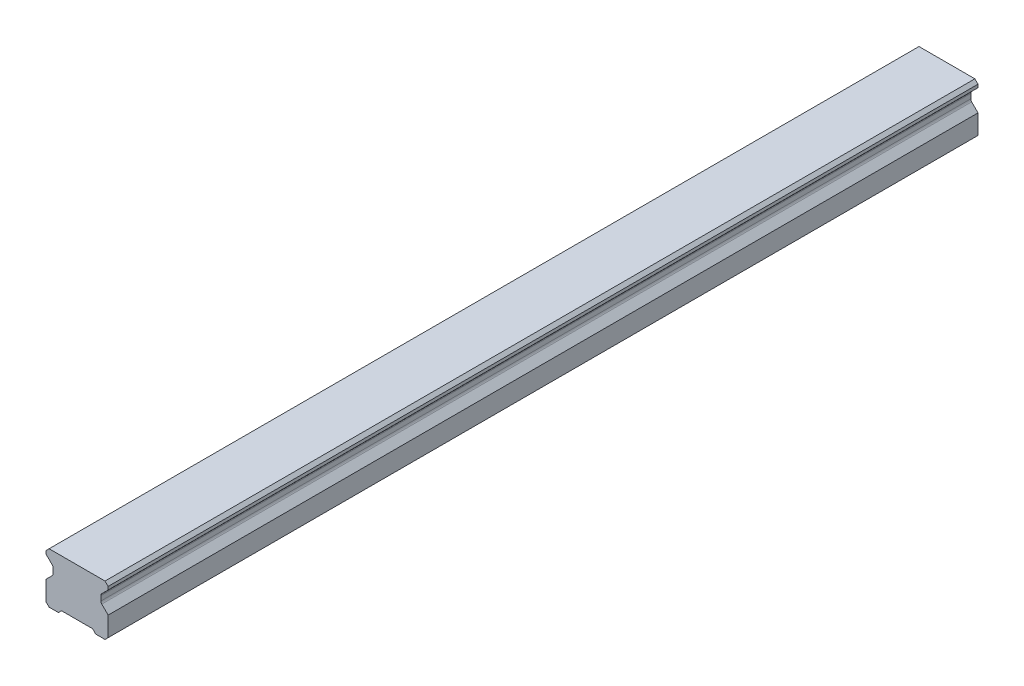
ISO-10303-21;
HEADER;
FILE_DESCRIPTION(('STEP AP214'),'2;1');
FILE_NAME('part.step','',(''),(''),'','','');
FILE_SCHEMA(('AUTOMOTIVE_DESIGN { 1 0 10303 214 1 1 1 1 }'));
ENDSEC;
DATA;
#1=APPLICATION_CONTEXT('core data for automotive mechanical design processes');
#2=APPLICATION_PROTOCOL_DEFINITION('international standard','automotive_design',2000,#1);
#3=PRODUCT_CONTEXT('',#1,'mechanical');
#4=PRODUCT('Part','Part','',(#3));
#5=PRODUCT_RELATED_PRODUCT_CATEGORY('part','',(#4));
#6=PRODUCT_DEFINITION_FORMATION('','',#4);
#7=PRODUCT_DEFINITION_CONTEXT('part definition',#1,'design');
#8=PRODUCT_DEFINITION('design','',#6,#7);
#9=PRODUCT_DEFINITION_SHAPE('','',#8);
#10=(LENGTH_UNIT() NAMED_UNIT(*) SI_UNIT(.MILLI.,.METRE.));
#11=(NAMED_UNIT(*) PLANE_ANGLE_UNIT() SI_UNIT($,.RADIAN.));
#12=(NAMED_UNIT(*) SI_UNIT($,.STERADIAN.) SOLID_ANGLE_UNIT());
#13=UNCERTAINTY_MEASURE_WITH_UNIT(LENGTH_MEASURE(1.E-05),#10,'distance_accuracy_value','');
#14=(GEOMETRIC_REPRESENTATION_CONTEXT(3) GLOBAL_UNCERTAINTY_ASSIGNED_CONTEXT((#13)) GLOBAL_UNIT_ASSIGNED_CONTEXT((#10,
#11,#12)) REPRESENTATION_CONTEXT('',''));
#15=CARTESIAN_POINT('',(0.,0.,0.));
#16=DIRECTION('',(0.,0.,1.));
#17=DIRECTION('',(1.,0.,0.));
#18=AXIS2_PLACEMENT_3D('',#15,#16,#17);
#19=CARTESIAN_POINT('',(0.,11.,-120.));
#20=DIRECTION('',(0.,-1.,0.));
#21=DIRECTION('',(0.,0.,-1.));
#22=AXIS2_PLACEMENT_3D('',#19,#20,#21);
#23=PLANE('',#22);
#24=CARTESIAN_POINT('',(0.,11.,-120.));
#25=DIRECTION('',(0.,-1.,0.));
#26=DIRECTION('',(0.,0.,-1.));
#27=AXIS2_PLACEMENT_3D('',#24,#25,#26);
#28=CIRCLE('',#27,2.5);
#29=CARTESIAN_POINT('',(0.,11.,-122.5));
#30=VERTEX_POINT('',#29);
#31=EDGE_CURVE('E42',#30,#30,#28,.T.);
#32=ORIENTED_EDGE('',*,*,#31,.F.);
#33=EDGE_LOOP('',(#32));
#34=FACE_BOUND('',#33,.T.);
#35=CARTESIAN_POINT('',(0.,11.,-120.));
#36=DIRECTION('',(0.,-1.,0.));
#37=DIRECTION('',(0.,0.,-1.));
#38=AXIS2_PLACEMENT_3D('',#35,#36,#37);
#39=CIRCLE('',#38,3.);
#40=CARTESIAN_POINT('',(0.,11.,-123.));
#41=VERTEX_POINT('',#40);
#42=EDGE_CURVE('E11',#41,#41,#39,.T.);
#43=ORIENTED_EDGE('',*,*,#42,.T.);
#44=EDGE_LOOP('',(#43));
#45=FACE_BOUND('',#44,.T.);
#46=ADVANCED_FACE('F39',(#34,#45),#23,.T.);
#47=CARTESIAN_POINT('',(0.,11.,-120.));
#48=DIRECTION('',(0.,-1.,0.));
#49=DIRECTION('',(0.,0.,-1.));
#50=AXIS2_PLACEMENT_3D('',#47,#48,#49);
#51=CYLINDRICAL_SURFACE('',#50,3.);
#52=ORIENTED_EDGE('',*,*,#42,.F.);
#53=EDGE_LOOP('',(#52));
#54=FACE_BOUND('',#53,.T.);
#55=CARTESIAN_POINT('',(0.,0.999999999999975,-120.));
#56=DIRECTION('',(0.,-1.,0.));
#57=DIRECTION('',(0.,0.,-1.));
#58=AXIS2_PLACEMENT_3D('',#55,#56,#57);
#59=CIRCLE('',#58,3.);
#60=CARTESIAN_POINT('',(0.,0.999999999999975,-123.));
#61=VERTEX_POINT('',#60);
#62=EDGE_CURVE('E48',#61,#61,#59,.T.);
#63=ORIENTED_EDGE('',*,*,#62,.T.);
#64=EDGE_LOOP('',(#63));
#65=FACE_BOUND('',#64,.T.);
#66=ADVANCED_FACE('F538',(#54,#65),#51,.F.);
#67=CARTESIAN_POINT('',(0.,11.,-60.));
#68=DIRECTION('',(0.,-1.,0.));
#69=DIRECTION('',(0.,0.,-1.));
#70=AXIS2_PLACEMENT_3D('',#67,#68,#69);
#71=PLANE('',#70);
#72=CARTESIAN_POINT('',(0.,11.,-60.));
#73=DIRECTION('',(0.,-1.,0.));
#74=DIRECTION('',(0.,0.,-1.));
#75=AXIS2_PLACEMENT_3D('',#72,#73,#74);
#76=CIRCLE('',#75,2.5);
#77=CARTESIAN_POINT('',(0.,11.,-62.5));
#78=VERTEX_POINT('',#77);
#79=EDGE_CURVE('E524',#78,#78,#76,.T.);
#80=ORIENTED_EDGE('',*,*,#79,.F.);
#81=EDGE_LOOP('',(#80));
#82=FACE_BOUND('',#81,.T.);
#83=CARTESIAN_POINT('',(0.,11.,-60.));
#84=DIRECTION('',(0.,-1.,0.));
#85=DIRECTION('',(0.,0.,-1.));
#86=AXIS2_PLACEMENT_3D('',#83,#84,#85);
#87=CIRCLE('',#86,3.);
#88=CARTESIAN_POINT('',(0.,11.,-63.));
#89=VERTEX_POINT('',#88);
#90=EDGE_CURVE('E515',#89,#89,#87,.T.);
#91=ORIENTED_EDGE('',*,*,#90,.T.);
#92=EDGE_LOOP('',(#91));
#93=FACE_BOUND('',#92,.T.);
#94=ADVANCED_FACE('F543',(#82,#93),#71,.T.);
#95=CARTESIAN_POINT('',(0.,11.,-60.));
#96=DIRECTION('',(0.,-1.,0.));
#97=DIRECTION('',(0.,0.,-1.));
#98=AXIS2_PLACEMENT_3D('',#95,#96,#97);
#99=CYLINDRICAL_SURFACE('',#98,3.);
#100=ORIENTED_EDGE('',*,*,#90,.F.);
#101=EDGE_LOOP('',(#100));
#102=FACE_BOUND('',#101,.T.);
#103=CARTESIAN_POINT('',(0.,0.999999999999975,-60.));
#104=DIRECTION('',(0.,-1.,0.));
#105=DIRECTION('',(0.,0.,-1.));
#106=AXIS2_PLACEMENT_3D('',#103,#104,#105);
#107=CIRCLE('',#106,3.);
#108=CARTESIAN_POINT('',(0.,0.999999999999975,-63.));
#109=VERTEX_POINT('',#108);
#110=EDGE_CURVE('E511',#109,#109,#107,.T.);
#111=ORIENTED_EDGE('',*,*,#110,.T.);
#112=EDGE_LOOP('',(#111));
#113=FACE_BOUND('',#112,.T.);
#114=ADVANCED_FACE('F654',(#102,#113),#99,.F.);
#115=CARTESIAN_POINT('',(0.,11.,0.));
#116=DIRECTION('',(0.,-1.,0.));
#117=DIRECTION('',(0.,0.,-1.));
#118=AXIS2_PLACEMENT_3D('',#115,#116,#117);
#119=PLANE('',#118);
#120=CARTESIAN_POINT('',(0.,11.,0.));
#121=DIRECTION('',(0.,-1.,0.));
#122=DIRECTION('',(0.,0.,-1.));
#123=AXIS2_PLACEMENT_3D('',#120,#121,#122);
#124=CIRCLE('',#123,2.5);
#125=CARTESIAN_POINT('',(0.,11.,-2.49999999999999));
#126=VERTEX_POINT('',#125);
#127=EDGE_CURVE('E233',#126,#126,#124,.T.);
#128=ORIENTED_EDGE('',*,*,#127,.F.);
#129=EDGE_LOOP('',(#128));
#130=FACE_BOUND('',#129,.T.);
#131=CARTESIAN_POINT('',(0.,11.,0.));
#132=DIRECTION('',(0.,-1.,0.));
#133=DIRECTION('',(0.,0.,-1.));
#134=AXIS2_PLACEMENT_3D('',#131,#132,#133);
#135=CIRCLE('',#134,3.);
#136=CARTESIAN_POINT('',(0.,11.,-2.99999999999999));
#137=VERTEX_POINT('',#136);
#138=EDGE_CURVE('E507',#137,#137,#135,.T.);
#139=ORIENTED_EDGE('',*,*,#138,.T.);
#140=EDGE_LOOP('',(#139));
#141=FACE_BOUND('',#140,.T.);
#142=ADVANCED_FACE('F650',(#130,#141),#119,.T.);
#143=CARTESIAN_POINT('',(0.,11.,0.));
#144=DIRECTION('',(0.,-1.,0.));
#145=DIRECTION('',(0.,0.,-1.));
#146=AXIS2_PLACEMENT_3D('',#143,#144,#145);
#147=CYLINDRICAL_SURFACE('',#146,3.);
#148=ORIENTED_EDGE('',*,*,#138,.F.);
#149=EDGE_LOOP('',(#148));
#150=FACE_BOUND('',#149,.T.);
#151=CARTESIAN_POINT('',(0.,0.999999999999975,0.));
#152=DIRECTION('',(0.,-1.,0.));
#153=DIRECTION('',(0.,0.,-1.));
#154=AXIS2_PLACEMENT_3D('',#151,#152,#153);
#155=CIRCLE('',#154,3.);
#156=CARTESIAN_POINT('',(0.,0.999999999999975,-2.99999999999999));
#157=VERTEX_POINT('',#156);
#158=EDGE_CURVE('E503',#157,#157,#155,.T.);
#159=ORIENTED_EDGE('',*,*,#158,.T.);
#160=EDGE_LOOP('',(#159));
#161=FACE_BOUND('',#160,.T.);
#162=ADVANCED_FACE('F647',(#150,#161),#147,.F.);
#163=CARTESIAN_POINT('',(10.,0.,140.));
#164=DIRECTION('',(0.,1.,0.));
#165=DIRECTION('',(-1.,0.,0.));
#166=AXIS2_PLACEMENT_3D('',#163,#164,#165);
#167=PLANE('',#166);
#168=DIRECTION('',(1.,0.,0.));
#169=VECTOR('',#168,1.);
#170=CARTESIAN_POINT('',(10.,0.,-140.));
#171=LINE('',#170,#169);
#172=CARTESIAN_POINT('',(-8.99999999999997,0.,-140.));
#173=VERTEX_POINT('',#172);
#174=CARTESIAN_POINT('',(-5.99999999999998,0.,-140.));
#175=VERTEX_POINT('',#174);
#176=EDGE_CURVE('E386',#173,#175,#171,.T.);
#177=ORIENTED_EDGE('',*,*,#176,.T.);
#178=DIRECTION('',(0.,0.,1.));
#179=VECTOR('',#178,1.);
#180=CARTESIAN_POINT('',(-5.99999999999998,0.,-140.));
#181=LINE('',#180,#179);
#182=CARTESIAN_POINT('',(-5.99999999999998,0.,140.));
#183=VERTEX_POINT('',#182);
#184=EDGE_CURVE('E293',#175,#183,#181,.T.);
#185=ORIENTED_EDGE('',*,*,#184,.T.);
#186=DIRECTION('',(1.,0.,0.));
#187=VECTOR('',#186,1.);
#188=CARTESIAN_POINT('',(10.,0.,140.));
#189=LINE('',#188,#187);
#190=CARTESIAN_POINT('',(-8.99999999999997,0.,140.));
#191=VERTEX_POINT('',#190);
#192=EDGE_CURVE('E368',#191,#183,#189,.T.);
#193=ORIENTED_EDGE('',*,*,#192,.F.);
#194=DIRECTION('',(0.,0.,-1.));
#195=VECTOR('',#194,1.);
#196=CARTESIAN_POINT('',(-8.99999999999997,0.,140.));
#197=LINE('',#196,#195);
#198=EDGE_CURVE('E438',#191,#173,#197,.T.);
#199=ORIENTED_EDGE('',*,*,#198,.T.);
#200=EDGE_LOOP('',(#177,#185,#193,#199));
#201=FACE_BOUND('',#200,.T.);
#202=ADVANCED_FACE('F612',(#201),#167,.F.);
#203=CARTESIAN_POINT('',(-10.,16.3,140.));
#204=DIRECTION('',(1.,0.,0.));
#205=DIRECTION('',(0.,1.,0.));
#206=AXIS2_PLACEMENT_3D('',#203,#204,#205);
#207=PLANE('',#206);
#208=DIRECTION('',(0.,-1.,0.));
#209=VECTOR('',#208,1.);
#210=CARTESIAN_POINT('',(-10.,16.3,140.));
#211=LINE('',#210,#209);
#212=CARTESIAN_POINT('',(-10.,15.3,140.));
#213=VERTEX_POINT('',#212);
#214=CARTESIAN_POINT('',(-10.,14.3,140.));
#215=VERTEX_POINT('',#214);
#216=EDGE_CURVE('E362',#213,#215,#211,.T.);
#217=ORIENTED_EDGE('',*,*,#216,.F.);
#218=DIRECTION('',(0.,0.,-1.));
#219=VECTOR('',#218,1.);
#220=CARTESIAN_POINT('',(-10.,15.3,140.));
#221=LINE('',#220,#219);
#222=CARTESIAN_POINT('',(-10.,15.3,-140.));
#223=VERTEX_POINT('',#222);
#224=EDGE_CURVE('E380',#213,#223,#221,.T.);
#225=ORIENTED_EDGE('',*,*,#224,.T.);
#226=DIRECTION('',(0.,-1.,0.));
#227=VECTOR('',#226,1.);
#228=CARTESIAN_POINT('',(-10.,16.3,-140.));
#229=LINE('',#228,#227);
#230=CARTESIAN_POINT('',(-10.,14.3,-140.));
#231=VERTEX_POINT('',#230);
#232=EDGE_CURVE('E381',#223,#231,#229,.T.);
#233=ORIENTED_EDGE('',*,*,#232,.T.);
#234=DIRECTION('',(0.,0.,1.));
#235=VECTOR('',#234,1.);
#236=CARTESIAN_POINT('',(-10.,14.3,-140.));
#237=LINE('',#236,#235);
#238=EDGE_CURVE('E316',#231,#215,#237,.T.);
#239=ORIENTED_EDGE('',*,*,#238,.T.);
#240=EDGE_LOOP('',(#217,#225,#233,#239));
#241=FACE_BOUND('',#240,.T.);
#242=ADVANCED_FACE('F616',(#241),#207,.F.);
#243=CARTESIAN_POINT('',(10.,16.3,140.));
#244=DIRECTION('',(-1.,0.,0.));
#245=DIRECTION('',(0.,-1.,0.));
#246=AXIS2_PLACEMENT_3D('',#243,#244,#245);
#247=PLANE('',#246);
#248=DIRECTION('',(0.,1.,0.));
#249=VECTOR('',#248,1.);
#250=CARTESIAN_POINT('',(10.,16.3,140.));
#251=LINE('',#250,#249);
#252=CARTESIAN_POINT('',(10.,1.,140.));
#253=VERTEX_POINT('',#252);
#254=CARTESIAN_POINT('',(10.,7.3,140.));
#255=VERTEX_POINT('',#254);
#256=EDGE_CURVE('E373',#253,#255,#251,.T.);
#257=ORIENTED_EDGE('',*,*,#256,.F.);
#258=DIRECTION('',(0.,0.,-1.));
#259=VECTOR('',#258,1.);
#260=CARTESIAN_POINT('',(10.,1.,140.));
#261=LINE('',#260,#259);
#262=CARTESIAN_POINT('',(10.,1.,-140.));
#263=VERTEX_POINT('',#262);
#264=EDGE_CURVE('E445',#253,#263,#261,.T.);
#265=ORIENTED_EDGE('',*,*,#264,.T.);
#266=DIRECTION('',(0.,1.,0.));
#267=VECTOR('',#266,1.);
#268=CARTESIAN_POINT('',(10.,16.3,-140.));
#269=LINE('',#268,#267);
#270=CARTESIAN_POINT('',(10.,7.3,-140.));
#271=VERTEX_POINT('',#270);
#272=EDGE_CURVE('E391',#263,#271,#269,.T.);
#273=ORIENTED_EDGE('',*,*,#272,.T.);
#274=DIRECTION('',(0.,0.,1.));
#275=VECTOR('',#274,1.);
#276=CARTESIAN_POINT('',(10.,7.3,-140.));
#277=LINE('',#276,#275);
#278=EDGE_CURVE('E347',#271,#255,#277,.T.);
#279=ORIENTED_EDGE('',*,*,#278,.T.);
#280=EDGE_LOOP('',(#257,#265,#273,#279));
#281=FACE_BOUND('',#280,.T.);
#282=ADVANCED_FACE('F607',(#281),#247,.F.);
#283=CARTESIAN_POINT('',(-10.,7.3,-140.));
#284=VERTEX_POINT('',#283);
#285=CARTESIAN_POINT('',(-10.,1.00000000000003,-140.));
#286=VERTEX_POINT('',#285);
#287=EDGE_CURVE('E331',#284,#286,#229,.T.);
#288=ORIENTED_EDGE('',*,*,#287,.T.);
#289=DIRECTION('',(0.,0.,1.));
#290=VECTOR('',#289,1.);
#291=CARTESIAN_POINT('',(-10.,1.00000000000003,140.));
#292=LINE('',#291,#290);
#293=CARTESIAN_POINT('',(-10.,1.00000000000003,140.));
#294=VERTEX_POINT('',#293);
#295=EDGE_CURVE('E442',#286,#294,#292,.T.);
#296=ORIENTED_EDGE('',*,*,#295,.T.);
#297=CARTESIAN_POINT('',(-10.,7.3,140.));
#298=VERTEX_POINT('',#297);
#299=EDGE_CURVE('E367',#298,#294,#211,.T.);
#300=ORIENTED_EDGE('',*,*,#299,.F.);
#301=DIRECTION('',(0.,0.,1.));
#302=VECTOR('',#301,1.);
#303=CARTESIAN_POINT('',(-10.,7.3,-140.));
#304=LINE('',#303,#302);
#305=EDGE_CURVE('E328',#284,#298,#304,.T.);
#306=ORIENTED_EDGE('',*,*,#305,.F.);
#307=EDGE_LOOP('',(#288,#296,#300,#306));
#308=FACE_BOUND('',#307,.T.);
#309=ADVANCED_FACE('F610',(#308),#207,.F.);
#310=CARTESIAN_POINT('',(5.99999999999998,0.,140.));
#311=VERTEX_POINT('',#310);
#312=CARTESIAN_POINT('',(9.,0.,140.));
#313=VERTEX_POINT('',#312);
#314=EDGE_CURVE('E366',#311,#313,#189,.T.);
#315=ORIENTED_EDGE('',*,*,#314,.F.);
#316=DIRECTION('',(0.,0.,1.));
#317=VECTOR('',#316,1.);
#318=CARTESIAN_POINT('',(5.99999999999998,0.,-140.));
#319=LINE('',#318,#317);
#320=CARTESIAN_POINT('',(5.99999999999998,0.,-140.));
#321=VERTEX_POINT('',#320);
#322=EDGE_CURVE('E283',#321,#311,#319,.T.);
#323=ORIENTED_EDGE('',*,*,#322,.F.);
#324=CARTESIAN_POINT('',(9.,0.,-140.));
#325=VERTEX_POINT('',#324);
#326=EDGE_CURVE('E385',#321,#325,#171,.T.);
#327=ORIENTED_EDGE('',*,*,#326,.T.);
#328=DIRECTION('',(0.,0.,1.));
#329=VECTOR('',#328,1.);
#330=CARTESIAN_POINT('',(9.,0.,140.));
#331=LINE('',#330,#329);
#332=EDGE_CURVE('E434',#325,#313,#331,.T.);
#333=ORIENTED_EDGE('',*,*,#332,.T.);
#334=EDGE_LOOP('',(#315,#323,#327,#333));
#335=FACE_BOUND('',#334,.T.);
#336=ADVANCED_FACE('F605',(#335),#167,.F.);
#337=CARTESIAN_POINT('',(10.,14.3,-140.));
#338=VERTEX_POINT('',#337);
#339=CARTESIAN_POINT('',(10.,15.3,-140.));
#340=VERTEX_POINT('',#339);
#341=EDGE_CURVE('E390',#338,#340,#269,.T.);
#342=ORIENTED_EDGE('',*,*,#341,.T.);
#343=DIRECTION('',(0.,0.,1.));
#344=VECTOR('',#343,1.);
#345=CARTESIAN_POINT('',(10.,15.3,140.));
#346=LINE('',#345,#344);
#347=CARTESIAN_POINT('',(10.,15.3,140.));
#348=VERTEX_POINT('',#347);
#349=EDGE_CURVE('E449',#340,#348,#346,.T.);
#350=ORIENTED_EDGE('',*,*,#349,.T.);
#351=CARTESIAN_POINT('',(10.,14.3,140.));
#352=VERTEX_POINT('',#351);
#353=EDGE_CURVE('E372',#352,#348,#251,.T.);
#354=ORIENTED_EDGE('',*,*,#353,.F.);
#355=DIRECTION('',(0.,0.,1.));
#356=VECTOR('',#355,1.);
#357=CARTESIAN_POINT('',(10.,14.3,-140.));
#358=LINE('',#357,#356);
#359=EDGE_CURVE('E321',#338,#352,#358,.T.);
#360=ORIENTED_EDGE('',*,*,#359,.F.);
#361=EDGE_LOOP('',(#342,#350,#354,#360));
#362=FACE_BOUND('',#361,.T.);
#363=ADVANCED_FACE('F601',(#362),#247,.F.);
#364=CARTESIAN_POINT('',(10.,16.3,140.));
#365=DIRECTION('',(0.,-1.,0.));
#366=DIRECTION('',(0.,0.,-1.));
#367=AXIS2_PLACEMENT_3D('',#364,#365,#366);
#368=PLANE('',#367);
#369=DIRECTION('',(-1.,0.,0.));
#370=VECTOR('',#369,1.);
#371=CARTESIAN_POINT('',(10.,16.3,-140.));
#372=LINE('',#371,#370);
#373=CARTESIAN_POINT('',(9.00000000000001,16.3,-140.));
#374=VERTEX_POINT('',#373);
#375=CARTESIAN_POINT('',(-9.,16.3,-140.));
#376=VERTEX_POINT('',#375);
#377=EDGE_CURVE('E395',#374,#376,#372,.T.);
#378=ORIENTED_EDGE('',*,*,#377,.T.);
#379=DIRECTION('',(0.,0.,1.));
#380=VECTOR('',#379,1.);
#381=CARTESIAN_POINT('',(-9.,16.3,140.));
#382=LINE('',#381,#380);
#383=CARTESIAN_POINT('',(-9.,16.3,140.));
#384=VERTEX_POINT('',#383);
#385=EDGE_CURVE('E419',#376,#384,#382,.T.);
#386=ORIENTED_EDGE('',*,*,#385,.T.);
#387=DIRECTION('',(-1.,0.,0.));
#388=VECTOR('',#387,1.);
#389=CARTESIAN_POINT('',(10.,16.3,140.));
#390=LINE('',#389,#388);
#391=CARTESIAN_POINT('',(9.00000000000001,16.3,140.));
#392=VERTEX_POINT('',#391);
#393=EDGE_CURVE('E376',#392,#384,#390,.T.);
#394=ORIENTED_EDGE('',*,*,#393,.F.);
#395=DIRECTION('',(0.,0.,-1.));
#396=VECTOR('',#395,1.);
#397=CARTESIAN_POINT('',(9.00000000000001,16.3,140.));
#398=LINE('',#397,#396);
#399=EDGE_CURVE('E415',#392,#374,#398,.T.);
#400=ORIENTED_EDGE('',*,*,#399,.T.);
#401=EDGE_LOOP('',(#378,#386,#394,#400));
#402=FACE_BOUND('',#401,.T.);
#403=ADVANCED_FACE('F595',(#402),#368,.F.);
#404=CARTESIAN_POINT('',(0.,0.,140.));
#405=DIRECTION('',(0.,0.,-1.));
#406=DIRECTION('',(-1.,0.,0.));
#407=AXIS2_PLACEMENT_3D('',#404,#405,#406);
#408=PLANE('',#407);
#409=ORIENTED_EDGE('',*,*,#192,.T.);
#410=DIRECTION('',(-0.707106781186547,-0.707106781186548,0.));
#411=VECTOR('',#410,1.);
#412=CARTESIAN_POINT('',(-5.99999999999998,0.,140.));
#413=LINE('',#412,#411);
#414=CARTESIAN_POINT('',(-5.,0.999999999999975,140.));
#415=VERTEX_POINT('',#414);
#416=EDGE_CURVE('E276',#415,#183,#413,.T.);
#417=ORIENTED_EDGE('',*,*,#416,.F.);
#418=DIRECTION('',(-1.,0.,0.));
#419=VECTOR('',#418,1.);
#420=CARTESIAN_POINT('',(-5.,0.999999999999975,140.));
#421=LINE('',#420,#419);
#422=CARTESIAN_POINT('',(5.,0.999999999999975,140.));
#423=VERTEX_POINT('',#422);
#424=EDGE_CURVE('E287',#423,#415,#421,.T.);
#425=ORIENTED_EDGE('',*,*,#424,.F.);
#426=DIRECTION('',(-0.707106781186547,0.707106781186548,0.));
#427=VECTOR('',#426,1.);
#428=CARTESIAN_POINT('',(5.,0.999999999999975,140.));
#429=LINE('',#428,#427);
#430=EDGE_CURVE('E268',#311,#423,#429,.T.);
#431=ORIENTED_EDGE('',*,*,#430,.F.);
#432=ORIENTED_EDGE('',*,*,#314,.T.);
#433=DIRECTION('',(-0.707106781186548,-0.707106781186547,0.));
#434=VECTOR('',#433,1.);
#435=CARTESIAN_POINT('',(10.,1.,140.));
#436=LINE('',#435,#434);
#437=EDGE_CURVE('E425',#313,#253,#436,.F.);
#438=ORIENTED_EDGE('',*,*,#437,.T.);
#439=ORIENTED_EDGE('',*,*,#256,.T.);
#440=DIRECTION('',(0.707106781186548,-0.707106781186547,0.));
#441=VECTOR('',#440,1.);
#442=CARTESIAN_POINT('',(10.,7.3,140.));
#443=LINE('',#442,#441);
#444=CARTESIAN_POINT('',(7.95955988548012,9.34044011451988,140.));
#445=VERTEX_POINT('',#444);
#446=EDGE_CURVE('E297',#445,#255,#443,.T.);
#447=ORIENTED_EDGE('',*,*,#446,.F.);
#448=CARTESIAN_POINT('',(8.66666666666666,10.0475468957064,140.));
#449=DIRECTION('',(0.,0.,-1.));
#450=DIRECTION('',(-1.,0.,0.));
#451=AXIS2_PLACEMENT_3D('',#448,#449,#450);
#452=CIRCLE('',#451,1.);
#453=CARTESIAN_POINT('',(7.66666666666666,10.0475468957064,140.));
#454=VERTEX_POINT('',#453);
#455=EDGE_CURVE('E480',#445,#454,#452,.T.);
#456=ORIENTED_EDGE('',*,*,#455,.T.);
#457=DIRECTION('',(0.,-1.,0.));
#458=VECTOR('',#457,1.);
#459=CARTESIAN_POINT('',(7.66666666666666,9.63333333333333,140.));
#460=LINE('',#459,#458);
#461=CARTESIAN_POINT('',(7.66666666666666,11.5524531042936,140.));
#462=VERTEX_POINT('',#461);
#463=EDGE_CURVE('E339',#462,#454,#460,.T.);
#464=ORIENTED_EDGE('',*,*,#463,.F.);
#465=CARTESIAN_POINT('',(8.66666666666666,11.5524531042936,140.));
#466=DIRECTION('',(0.,0.,-1.));
#467=DIRECTION('',(-1.,0.,0.));
#468=AXIS2_PLACEMENT_3D('',#465,#466,#467);
#469=CIRCLE('',#468,1.);
#470=CARTESIAN_POINT('',(7.95955988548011,12.2595598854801,140.));
#471=VERTEX_POINT('',#470);
#472=EDGE_CURVE('E486',#462,#471,#469,.T.);
#473=ORIENTED_EDGE('',*,*,#472,.T.);
#474=DIRECTION('',(-0.707106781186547,-0.707106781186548,0.));
#475=VECTOR('',#474,1.);
#476=CARTESIAN_POINT('',(7.66666666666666,11.9666666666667,140.));
#477=LINE('',#476,#475);
#478=EDGE_CURVE('E350',#352,#471,#477,.T.);
#479=ORIENTED_EDGE('',*,*,#478,.F.);
#480=ORIENTED_EDGE('',*,*,#353,.T.);
#481=DIRECTION('',(0.707106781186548,-0.707106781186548,0.));
#482=VECTOR('',#481,1.);
#483=CARTESIAN_POINT('',(9.00000000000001,16.3,140.));
#484=LINE('',#483,#482);
#485=EDGE_CURVE('E422',#348,#392,#484,.F.);
#486=ORIENTED_EDGE('',*,*,#485,.T.);
#487=ORIENTED_EDGE('',*,*,#393,.T.);
#488=DIRECTION('',(0.707106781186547,0.707106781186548,0.));
#489=VECTOR('',#488,1.);
#490=CARTESIAN_POINT('',(-10.,15.3,140.));
#491=LINE('',#490,#489);
#492=EDGE_CURVE('E431',#384,#213,#491,.F.);
#493=ORIENTED_EDGE('',*,*,#492,.T.);
#494=ORIENTED_EDGE('',*,*,#216,.T.);
#495=DIRECTION('',(-0.707106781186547,0.707106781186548,0.));
#496=VECTOR('',#495,1.);
#497=CARTESIAN_POINT('',(-7.66666666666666,11.9666666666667,140.));
#498=LINE('',#497,#496);
#499=CARTESIAN_POINT('',(-7.95955988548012,12.2595598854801,140.));
#500=VERTEX_POINT('',#499);
#501=EDGE_CURVE('E317',#500,#215,#498,.T.);
#502=ORIENTED_EDGE('',*,*,#501,.F.);
#503=CARTESIAN_POINT('',(-8.66666666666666,11.5524531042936,140.));
#504=DIRECTION('',(0.,0.,-1.));
#505=DIRECTION('',(-1.,0.,0.));
#506=AXIS2_PLACEMENT_3D('',#503,#504,#505);
#507=CIRCLE('',#506,1.);
#508=CARTESIAN_POINT('',(-7.66666666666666,11.5524531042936,140.));
#509=VERTEX_POINT('',#508);
#510=EDGE_CURVE('E498',#500,#509,#507,.T.);
#511=ORIENTED_EDGE('',*,*,#510,.T.);
#512=DIRECTION('',(0.,1.,0.));
#513=VECTOR('',#512,1.);
#514=CARTESIAN_POINT('',(-7.66666666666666,9.63333333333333,140.));
#515=LINE('',#514,#513);
#516=CARTESIAN_POINT('',(-7.66666666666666,10.0475468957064,140.));
#517=VERTEX_POINT('',#516);
#518=EDGE_CURVE('E309',#517,#509,#515,.T.);
#519=ORIENTED_EDGE('',*,*,#518,.F.);
#520=CARTESIAN_POINT('',(-8.66666666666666,10.0475468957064,140.));
#521=DIRECTION('',(0.,0.,-1.));
#522=DIRECTION('',(-1.,0.,0.));
#523=AXIS2_PLACEMENT_3D('',#520,#521,#522);
#524=CIRCLE('',#523,1.);
#525=CARTESIAN_POINT('',(-7.95955988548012,9.34044011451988,140.));
#526=VERTEX_POINT('',#525);
#527=EDGE_CURVE('E492',#517,#526,#524,.T.);
#528=ORIENTED_EDGE('',*,*,#527,.T.);
#529=DIRECTION('',(0.707106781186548,0.707106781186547,0.));
#530=VECTOR('',#529,1.);
#531=CARTESIAN_POINT('',(-10.,7.3,140.));
#532=LINE('',#531,#530);
#533=EDGE_CURVE('E320',#298,#526,#532,.T.);
#534=ORIENTED_EDGE('',*,*,#533,.F.);
#535=ORIENTED_EDGE('',*,*,#299,.T.);
#536=DIRECTION('',(-0.707106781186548,0.707106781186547,0.));
#537=VECTOR('',#536,1.);
#538=CARTESIAN_POINT('',(-8.99999999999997,0.,140.));
#539=LINE('',#538,#537);
#540=EDGE_CURVE('E428',#294,#191,#539,.F.);
#541=ORIENTED_EDGE('',*,*,#540,.T.);
#542=EDGE_LOOP('',(#409,#417,#425,#431,#432,#438,#439,#447,#456,#464,#473,#479,#480,#486,#487,
#493,#494,#502,#511,#519,#528,#534,#535,#541));
#543=FACE_BOUND('',#542,.T.);
#544=ADVANCED_FACE('F592',(#543),#408,.F.);
#545=CARTESIAN_POINT('',(0.,0.,-140.));
#546=DIRECTION('',(0.,0.,-1.));
#547=DIRECTION('',(-1.,0.,0.));
#548=AXIS2_PLACEMENT_3D('',#545,#546,#547);
#549=PLANE('',#548);
#550=DIRECTION('',(-0.707106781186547,-0.707106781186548,0.));
#551=VECTOR('',#550,1.);
#552=CARTESIAN_POINT('',(-5.99999999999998,0.,-140.));
#553=LINE('',#552,#551);
#554=CARTESIAN_POINT('',(-5.,0.999999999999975,-140.));
#555=VERTEX_POINT('',#554);
#556=EDGE_CURVE('E279',#555,#175,#553,.T.);
#557=ORIENTED_EDGE('',*,*,#556,.T.);
#558=ORIENTED_EDGE('',*,*,#176,.F.);
#559=DIRECTION('',(0.707106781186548,-0.707106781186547,0.));
#560=VECTOR('',#559,1.);
#561=CARTESIAN_POINT('',(-4.49999999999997,-4.49999999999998,-140.));
#562=LINE('',#561,#560);
#563=EDGE_CURVE('E409',#173,#286,#562,.F.);
#564=ORIENTED_EDGE('',*,*,#563,.T.);
#565=ORIENTED_EDGE('',*,*,#287,.F.);
#566=DIRECTION('',(0.707106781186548,0.707106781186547,0.));
#567=VECTOR('',#566,1.);
#568=CARTESIAN_POINT('',(-10.,7.3,-140.));
#569=LINE('',#568,#567);
#570=CARTESIAN_POINT('',(-7.95955988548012,9.34044011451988,-140.));
#571=VERTEX_POINT('',#570);
#572=EDGE_CURVE('E308',#284,#571,#569,.T.);
#573=ORIENTED_EDGE('',*,*,#572,.T.);
#574=CARTESIAN_POINT('',(-8.66666666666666,10.0475468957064,-140.));
#575=DIRECTION('',(0.,0.,-1.));
#576=DIRECTION('',(-1.,0.,0.));
#577=AXIS2_PLACEMENT_3D('',#574,#575,#576);
#578=CIRCLE('',#577,1.);
#579=CARTESIAN_POINT('',(-7.66666666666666,10.0475468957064,-140.));
#580=VERTEX_POINT('',#579);
#581=EDGE_CURVE('E495',#571,#580,#578,.F.);
#582=ORIENTED_EDGE('',*,*,#581,.T.);
#583=DIRECTION('',(0.,1.,0.));
#584=VECTOR('',#583,1.);
#585=CARTESIAN_POINT('',(-7.66666666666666,9.63333333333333,-140.));
#586=LINE('',#585,#584);
#587=CARTESIAN_POINT('',(-7.66666666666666,11.5524531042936,-140.));
#588=VERTEX_POINT('',#587);
#589=EDGE_CURVE('E313',#580,#588,#586,.T.);
#590=ORIENTED_EDGE('',*,*,#589,.T.);
#591=CARTESIAN_POINT('',(-8.66666666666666,11.5524531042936,-140.));
#592=DIRECTION('',(0.,0.,-1.));
#593=DIRECTION('',(-1.,0.,0.));
#594=AXIS2_PLACEMENT_3D('',#591,#592,#593);
#595=CIRCLE('',#594,1.);
#596=CARTESIAN_POINT('',(-7.95955988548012,12.2595598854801,-140.));
#597=VERTEX_POINT('',#596);
#598=EDGE_CURVE('E64',#588,#597,#595,.F.);
#599=ORIENTED_EDGE('',*,*,#598,.T.);
#600=DIRECTION('',(-0.707106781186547,0.707106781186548,0.));
#601=VECTOR('',#600,1.);
#602=CARTESIAN_POINT('',(-7.66666666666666,11.9666666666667,-140.));
#603=LINE('',#602,#601);
#604=EDGE_CURVE('E305',#597,#231,#603,.T.);
#605=ORIENTED_EDGE('',*,*,#604,.T.);
#606=ORIENTED_EDGE('',*,*,#232,.F.);
#607=DIRECTION('',(-0.707106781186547,-0.707106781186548,0.));
#608=VECTOR('',#607,1.);
#609=CARTESIAN_POINT('',(-12.65,12.65,-140.));
#610=LINE('',#609,#608);
#611=EDGE_CURVE('E412',#223,#376,#610,.F.);
#612=ORIENTED_EDGE('',*,*,#611,.T.);
#613=ORIENTED_EDGE('',*,*,#377,.F.);
#614=DIRECTION('',(-0.707106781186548,0.707106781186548,0.));
#615=VECTOR('',#614,1.);
#616=CARTESIAN_POINT('',(12.65,12.65,-140.));
#617=LINE('',#616,#615);
#618=EDGE_CURVE('E402',#374,#340,#617,.F.);
#619=ORIENTED_EDGE('',*,*,#618,.T.);
#620=ORIENTED_EDGE('',*,*,#341,.F.);
#621=DIRECTION('',(-0.707106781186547,-0.707106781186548,0.));
#622=VECTOR('',#621,1.);
#623=CARTESIAN_POINT('',(7.66666666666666,11.9666666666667,-140.));
#624=LINE('',#623,#622);
#625=CARTESIAN_POINT('',(7.95955988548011,12.2595598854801,-140.));
#626=VERTEX_POINT('',#625);
#627=EDGE_CURVE('E338',#338,#626,#624,.T.);
#628=ORIENTED_EDGE('',*,*,#627,.T.);
#629=CARTESIAN_POINT('',(8.66666666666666,11.5524531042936,-140.));
#630=DIRECTION('',(0.,0.,-1.));
#631=DIRECTION('',(-1.,0.,0.));
#632=AXIS2_PLACEMENT_3D('',#629,#630,#631);
#633=CIRCLE('',#632,1.);
#634=CARTESIAN_POINT('',(7.66666666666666,11.5524531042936,-140.));
#635=VERTEX_POINT('',#634);
#636=EDGE_CURVE('E489',#626,#635,#633,.F.);
#637=ORIENTED_EDGE('',*,*,#636,.T.);
#638=DIRECTION('',(0.,-1.,0.));
#639=VECTOR('',#638,1.);
#640=CARTESIAN_POINT('',(7.66666666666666,9.63333333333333,-140.));
#641=LINE('',#640,#639);
#642=CARTESIAN_POINT('',(7.66666666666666,10.0475468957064,-140.));
#643=VERTEX_POINT('',#642);
#644=EDGE_CURVE('E343',#635,#643,#641,.T.);
#645=ORIENTED_EDGE('',*,*,#644,.T.);
#646=CARTESIAN_POINT('',(8.66666666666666,10.0475468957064,-140.));
#647=DIRECTION('',(0.,0.,-1.));
#648=DIRECTION('',(-1.,0.,0.));
#649=AXIS2_PLACEMENT_3D('',#646,#647,#648);
#650=CIRCLE('',#649,1.);
#651=CARTESIAN_POINT('',(7.95955988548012,9.34044011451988,-140.));
#652=VERTEX_POINT('',#651);
#653=EDGE_CURVE('E483',#643,#652,#650,.F.);
#654=ORIENTED_EDGE('',*,*,#653,.T.);
#655=DIRECTION('',(0.707106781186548,-0.707106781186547,0.));
#656=VECTOR('',#655,1.);
#657=CARTESIAN_POINT('',(10.,7.3,-140.));
#658=LINE('',#657,#656);
#659=EDGE_CURVE('E335',#652,#271,#658,.T.);
#660=ORIENTED_EDGE('',*,*,#659,.T.);
#661=ORIENTED_EDGE('',*,*,#272,.F.);
#662=DIRECTION('',(0.707106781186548,0.707106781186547,0.));
#663=VECTOR('',#662,1.);
#664=CARTESIAN_POINT('',(4.5,-4.5,-140.));
#665=LINE('',#664,#663);
#666=EDGE_CURVE('E405',#263,#325,#665,.F.);
#667=ORIENTED_EDGE('',*,*,#666,.T.);
#668=ORIENTED_EDGE('',*,*,#326,.F.);
#669=DIRECTION('',(-0.707106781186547,0.707106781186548,0.));
#670=VECTOR('',#669,1.);
#671=CARTESIAN_POINT('',(5.,0.999999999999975,-140.));
#672=LINE('',#671,#670);
#673=CARTESIAN_POINT('',(5.,0.999999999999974,-140.));
#674=VERTEX_POINT('',#673);
#675=EDGE_CURVE('E272',#321,#674,#672,.T.);
#676=ORIENTED_EDGE('',*,*,#675,.T.);
#677=DIRECTION('',(-1.,0.,0.));
#678=VECTOR('',#677,1.);
#679=CARTESIAN_POINT('',(-5.,0.999999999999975,-140.));
#680=LINE('',#679,#678);
#681=EDGE_CURVE('E56',#674,#555,#680,.T.);
#682=ORIENTED_EDGE('',*,*,#681,.T.);
#683=EDGE_LOOP('',(#557,#558,#564,#565,#573,#582,#590,#599,#605,#606,#612,#613,#619,#620,#628,
#637,#645,#654,#660,#661,#667,#668,#676,#682));
#684=FACE_BOUND('',#683,.T.);
#685=ADVANCED_FACE('F590',(#684),#549,.T.);
#686=CARTESIAN_POINT('',(10.,7.3,-140.));
#687=DIRECTION('',(-0.707106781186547,-0.707106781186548,0.));
#688=DIRECTION('',(0.707106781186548,-0.707106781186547,0.));
#689=AXIS2_PLACEMENT_3D('',#686,#687,#688);
#690=PLANE('',#689);
#691=ORIENTED_EDGE('',*,*,#659,.F.);
#692=DIRECTION('',(0.,0.,1.));
#693=VECTOR('',#692,1.);
#694=CARTESIAN_POINT('',(7.95955988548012,9.34044011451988,140.));
#695=LINE('',#694,#693);
#696=EDGE_CURVE('E452',#652,#445,#695,.T.);
#697=ORIENTED_EDGE('',*,*,#696,.T.);
#698=ORIENTED_EDGE('',*,*,#446,.T.);
#699=ORIENTED_EDGE('',*,*,#278,.F.);
#700=EDGE_LOOP('',(#691,#697,#698,#699));
#701=FACE_BOUND('',#700,.T.);
#702=ADVANCED_FACE('F583',(#701),#690,.F.);
#703=CARTESIAN_POINT('',(7.66666666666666,9.63333333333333,-140.));
#704=DIRECTION('',(-1.,0.,0.));
#705=DIRECTION('',(0.,-1.,0.));
#706=AXIS2_PLACEMENT_3D('',#703,#704,#705);
#707=PLANE('',#706);
#708=ORIENTED_EDGE('',*,*,#463,.T.);
#709=DIRECTION('',(0.,0.,1.));
#710=VECTOR('',#709,1.);
#711=CARTESIAN_POINT('',(7.66666666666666,10.0475468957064,-140.));
#712=LINE('',#711,#710);
#713=EDGE_CURVE('E460',#454,#643,#712,.F.);
#714=ORIENTED_EDGE('',*,*,#713,.T.);
#715=ORIENTED_EDGE('',*,*,#644,.F.);
#716=DIRECTION('',(0.,0.,1.));
#717=VECTOR('',#716,1.);
#718=CARTESIAN_POINT('',(7.66666666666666,11.5524531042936,140.));
#719=LINE('',#718,#717);
#720=EDGE_CURVE('E456',#635,#462,#719,.T.);
#721=ORIENTED_EDGE('',*,*,#720,.T.);
#722=EDGE_LOOP('',(#708,#714,#715,#721));
#723=FACE_BOUND('',#722,.T.);
#724=ADVANCED_FACE('F580',(#723),#707,.F.);
#725=CARTESIAN_POINT('',(7.66666666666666,11.9666666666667,-140.));
#726=DIRECTION('',(-0.707106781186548,0.707106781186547,0.));
#727=DIRECTION('',(-0.707106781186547,-0.707106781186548,0.));
#728=AXIS2_PLACEMENT_3D('',#725,#726,#727);
#729=PLANE('',#728);
#730=ORIENTED_EDGE('',*,*,#478,.T.);
#731=DIRECTION('',(0.,0.,1.));
#732=VECTOR('',#731,1.);
#733=CARTESIAN_POINT('',(7.95955988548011,12.2595598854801,-140.));
#734=LINE('',#733,#732);
#735=EDGE_CURVE('E463',#471,#626,#734,.F.);
#736=ORIENTED_EDGE('',*,*,#735,.T.);
#737=ORIENTED_EDGE('',*,*,#627,.F.);
#738=ORIENTED_EDGE('',*,*,#359,.T.);
#739=EDGE_LOOP('',(#730,#736,#737,#738));
#740=FACE_BOUND('',#739,.T.);
#741=ADVANCED_FACE('F578',(#740),#729,.F.);
#742=CARTESIAN_POINT('',(-7.66666666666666,11.9666666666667,-140.));
#743=DIRECTION('',(0.707106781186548,0.707106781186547,0.));
#744=DIRECTION('',(-0.707106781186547,0.707106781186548,0.));
#745=AXIS2_PLACEMENT_3D('',#742,#743,#744);
#746=PLANE('',#745);
#747=ORIENTED_EDGE('',*,*,#604,.F.);
#748=DIRECTION('',(0.,0.,1.));
#749=VECTOR('',#748,1.);
#750=CARTESIAN_POINT('',(-7.95955988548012,12.2595598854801,140.));
#751=LINE('',#750,#749);
#752=EDGE_CURVE('E476',#597,#500,#751,.T.);
#753=ORIENTED_EDGE('',*,*,#752,.T.);
#754=ORIENTED_EDGE('',*,*,#501,.T.);
#755=ORIENTED_EDGE('',*,*,#238,.F.);
#756=EDGE_LOOP('',(#747,#753,#754,#755));
#757=FACE_BOUND('',#756,.T.);
#758=ADVANCED_FACE('F570',(#757),#746,.F.);
#759=CARTESIAN_POINT('',(-7.66666666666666,9.63333333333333,-140.));
#760=DIRECTION('',(1.,0.,0.));
#761=DIRECTION('',(0.,1.,0.));
#762=AXIS2_PLACEMENT_3D('',#759,#760,#761);
#763=PLANE('',#762);
#764=ORIENTED_EDGE('',*,*,#589,.F.);
#765=DIRECTION('',(0.,0.,1.));
#766=VECTOR('',#765,1.);
#767=CARTESIAN_POINT('',(-7.66666666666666,10.0475468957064,140.));
#768=LINE('',#767,#766);
#769=EDGE_CURVE('E469',#580,#517,#768,.T.);
#770=ORIENTED_EDGE('',*,*,#769,.T.);
#771=ORIENTED_EDGE('',*,*,#518,.T.);
#772=DIRECTION('',(0.,0.,1.));
#773=VECTOR('',#772,1.);
#774=CARTESIAN_POINT('',(-7.66666666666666,11.5524531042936,-140.));
#775=LINE('',#774,#773);
#776=EDGE_CURVE('E466',#509,#588,#775,.F.);
#777=ORIENTED_EDGE('',*,*,#776,.T.);
#778=EDGE_LOOP('',(#764,#770,#771,#777));
#779=FACE_BOUND('',#778,.T.);
#780=ADVANCED_FACE('F566',(#779),#763,.F.);
#781=CARTESIAN_POINT('',(-10.,7.3,-140.));
#782=DIRECTION('',(0.707106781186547,-0.707106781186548,0.));
#783=DIRECTION('',(0.707106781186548,0.707106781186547,0.));
#784=AXIS2_PLACEMENT_3D('',#781,#782,#783);
#785=PLANE('',#784);
#786=ORIENTED_EDGE('',*,*,#533,.T.);
#787=DIRECTION('',(0.,0.,1.));
#788=VECTOR('',#787,1.);
#789=CARTESIAN_POINT('',(-7.95955988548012,9.34044011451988,-140.));
#790=LINE('',#789,#788);
#791=EDGE_CURVE('E473',#526,#571,#790,.F.);
#792=ORIENTED_EDGE('',*,*,#791,.T.);
#793=ORIENTED_EDGE('',*,*,#572,.F.);
#794=ORIENTED_EDGE('',*,*,#305,.T.);
#795=EDGE_LOOP('',(#786,#792,#793,#794));
#796=FACE_BOUND('',#795,.T.);
#797=ADVANCED_FACE('F569',(#796),#785,.F.);
#798=CARTESIAN_POINT('',(-10.,15.3,140.));
#799=DIRECTION('',(0.707106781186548,-0.707106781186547,0.));
#800=DIRECTION('',(0.,0.,-1.));
#801=AXIS2_PLACEMENT_3D('',#798,#799,#800);
#802=PLANE('',#801);
#803=ORIENTED_EDGE('',*,*,#492,.F.);
#804=ORIENTED_EDGE('',*,*,#385,.F.);
#805=ORIENTED_EDGE('',*,*,#611,.F.);
#806=ORIENTED_EDGE('',*,*,#224,.F.);
#807=EDGE_LOOP('',(#803,#804,#805,#806));
#808=FACE_BOUND('',#807,.T.);
#809=ADVANCED_FACE('F574',(#808),#802,.F.);
#810=CARTESIAN_POINT('',(-8.99999999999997,0.,140.));
#811=DIRECTION('',(0.707106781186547,0.707106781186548,0.));
#812=DIRECTION('',(0.,0.,-1.));
#813=AXIS2_PLACEMENT_3D('',#810,#811,#812);
#814=PLANE('',#813);
#815=ORIENTED_EDGE('',*,*,#540,.F.);
#816=ORIENTED_EDGE('',*,*,#295,.F.);
#817=ORIENTED_EDGE('',*,*,#563,.F.);
#818=ORIENTED_EDGE('',*,*,#198,.F.);
#819=EDGE_LOOP('',(#815,#816,#817,#818));
#820=FACE_BOUND('',#819,.T.);
#821=ADVANCED_FACE('F619',(#820),#814,.F.);
#822=CARTESIAN_POINT('',(10.,1.,140.));
#823=DIRECTION('',(-0.707106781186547,0.707106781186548,0.));
#824=DIRECTION('',(0.,0.,-1.));
#825=AXIS2_PLACEMENT_3D('',#822,#823,#824);
#826=PLANE('',#825);
#827=ORIENTED_EDGE('',*,*,#437,.F.);
#828=ORIENTED_EDGE('',*,*,#332,.F.);
#829=ORIENTED_EDGE('',*,*,#666,.F.);
#830=ORIENTED_EDGE('',*,*,#264,.F.);
#831=EDGE_LOOP('',(#827,#828,#829,#830));
#832=FACE_BOUND('',#831,.T.);
#833=ADVANCED_FACE('F623',(#832),#826,.F.);
#834=CARTESIAN_POINT('',(9.00000000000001,16.3,140.));
#835=DIRECTION('',(-0.707106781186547,-0.707106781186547,0.));
#836=DIRECTION('',(0.,0.,-1.));
#837=AXIS2_PLACEMENT_3D('',#834,#835,#836);
#838=PLANE('',#837);
#839=ORIENTED_EDGE('',*,*,#485,.F.);
#840=ORIENTED_EDGE('',*,*,#349,.F.);
#841=ORIENTED_EDGE('',*,*,#618,.F.);
#842=ORIENTED_EDGE('',*,*,#399,.F.);
#843=EDGE_LOOP('',(#839,#840,#841,#842));
#844=FACE_BOUND('',#843,.T.);
#845=ADVANCED_FACE('F627',(#844),#838,.F.);
#846=CARTESIAN_POINT('',(8.66666666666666,10.0475468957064,-140.));
#847=DIRECTION('',(0.,0.,-1.));
#848=DIRECTION('',(-1.,0.,0.));
#849=AXIS2_PLACEMENT_3D('',#846,#847,#848);
#850=CYLINDRICAL_SURFACE('',#849,1.);
#851=ORIENTED_EDGE('',*,*,#653,.F.);
#852=ORIENTED_EDGE('',*,*,#713,.F.);
#853=ORIENTED_EDGE('',*,*,#455,.F.);
#854=ORIENTED_EDGE('',*,*,#696,.F.);
#855=EDGE_LOOP('',(#851,#852,#853,#854));
#856=FACE_BOUND('',#855,.T.);
#857=ADVANCED_FACE('F631',(#856),#850,.F.);
#858=CARTESIAN_POINT('',(8.66666666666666,11.5524531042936,-140.));
#859=DIRECTION('',(0.,0.,-1.));
#860=DIRECTION('',(-1.,0.,0.));
#861=AXIS2_PLACEMENT_3D('',#858,#859,#860);
#862=CYLINDRICAL_SURFACE('',#861,1.);
#863=ORIENTED_EDGE('',*,*,#636,.F.);
#864=ORIENTED_EDGE('',*,*,#735,.F.);
#865=ORIENTED_EDGE('',*,*,#472,.F.);
#866=ORIENTED_EDGE('',*,*,#720,.F.);
#867=EDGE_LOOP('',(#863,#864,#865,#866));
#868=FACE_BOUND('',#867,.T.);
#869=ADVANCED_FACE('F635',(#868),#862,.F.);
#870=CARTESIAN_POINT('',(-8.66666666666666,10.0475468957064,-140.));
#871=DIRECTION('',(0.,0.,-1.));
#872=DIRECTION('',(-1.,0.,0.));
#873=AXIS2_PLACEMENT_3D('',#870,#871,#872);
#874=CYLINDRICAL_SURFACE('',#873,1.);
#875=ORIENTED_EDGE('',*,*,#581,.F.);
#876=ORIENTED_EDGE('',*,*,#791,.F.);
#877=ORIENTED_EDGE('',*,*,#527,.F.);
#878=ORIENTED_EDGE('',*,*,#769,.F.);
#879=EDGE_LOOP('',(#875,#876,#877,#878));
#880=FACE_BOUND('',#879,.T.);
#881=ADVANCED_FACE('F639',(#880),#874,.F.);
#882=CARTESIAN_POINT('',(-8.66666666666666,11.5524531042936,-140.));
#883=DIRECTION('',(0.,0.,-1.));
#884=DIRECTION('',(-1.,0.,0.));
#885=AXIS2_PLACEMENT_3D('',#882,#883,#884);
#886=CYLINDRICAL_SURFACE('',#885,1.);
#887=ORIENTED_EDGE('',*,*,#598,.F.);
#888=ORIENTED_EDGE('',*,*,#776,.F.);
#889=ORIENTED_EDGE('',*,*,#510,.F.);
#890=ORIENTED_EDGE('',*,*,#752,.F.);
#891=EDGE_LOOP('',(#887,#888,#889,#890));
#892=FACE_BOUND('',#891,.T.);
#893=ADVANCED_FACE('F559',(#892),#886,.F.);
#894=CARTESIAN_POINT('',(-5.99999999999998,0.,-140.));
#895=DIRECTION('',(-0.707106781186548,0.707106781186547,0.));
#896=DIRECTION('',(-0.707106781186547,-0.707106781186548,0.));
#897=AXIS2_PLACEMENT_3D('',#894,#895,#896);
#898=PLANE('',#897);
#899=ORIENTED_EDGE('',*,*,#416,.T.);
#900=ORIENTED_EDGE('',*,*,#184,.F.);
#901=ORIENTED_EDGE('',*,*,#556,.F.);
#902=DIRECTION('',(0.,0.,1.));
#903=VECTOR('',#902,1.);
#904=CARTESIAN_POINT('',(-5.,0.999999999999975,-140.));
#905=LINE('',#904,#903);
#906=EDGE_CURVE('E298',#555,#415,#905,.T.);
#907=ORIENTED_EDGE('',*,*,#906,.T.);
#908=EDGE_LOOP('',(#899,#900,#901,#907));
#909=FACE_BOUND('',#908,.T.);
#910=ADVANCED_FACE('F549',(#909),#898,.F.);
#911=CARTESIAN_POINT('',(-5.,0.999999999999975,-140.));
#912=DIRECTION('',(0.,1.,0.));
#913=DIRECTION('',(0.,0.,1.));
#914=AXIS2_PLACEMENT_3D('',#911,#912,#913);
#915=PLANE('',#914);
#916=CARTESIAN_POINT('',(0.,0.999999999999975,60.));
#917=DIRECTION('',(0.,-1.,0.));
#918=DIRECTION('',(0.,0.,-1.));
#919=AXIS2_PLACEMENT_3D('',#916,#917,#918);
#920=CIRCLE('',#919,3.);
#921=CARTESIAN_POINT('',(0.,0.999999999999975,57.));
#922=VERTEX_POINT('',#921);
#923=EDGE_CURVE('E247',#922,#922,#920,.T.);
#924=ORIENTED_EDGE('',*,*,#923,.F.);
#925=EDGE_LOOP('',(#924));
#926=FACE_BOUND('',#925,.T.);
#927=CARTESIAN_POINT('',(0.,0.999999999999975,120.));
#928=DIRECTION('',(0.,-1.,0.));
#929=DIRECTION('',(0.,0.,-1.));
#930=AXIS2_PLACEMENT_3D('',#927,#928,#929);
#931=CIRCLE('',#930,3.);
#932=CARTESIAN_POINT('',(0.,0.999999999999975,117.));
#933=VERTEX_POINT('',#932);
#934=EDGE_CURVE('E263',#933,#933,#931,.T.);
#935=ORIENTED_EDGE('',*,*,#934,.F.);
#936=EDGE_LOOP('',(#935));
#937=FACE_BOUND('',#936,.T.);
#938=ORIENTED_EDGE('',*,*,#424,.T.);
#939=ORIENTED_EDGE('',*,*,#906,.F.);
#940=ORIENTED_EDGE('',*,*,#681,.F.);
#941=DIRECTION('',(0.,0.,1.));
#942=VECTOR('',#941,1.);
#943=CARTESIAN_POINT('',(5.,0.999999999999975,-140.));
#944=LINE('',#943,#942);
#945=EDGE_CURVE('E300',#674,#423,#944,.T.);
#946=ORIENTED_EDGE('',*,*,#945,.T.);
#947=EDGE_LOOP('',(#938,#939,#940,#946));
#948=FACE_BOUND('',#947,.T.);
#949=ORIENTED_EDGE('',*,*,#158,.F.);
#950=EDGE_LOOP('',(#949));
#951=FACE_BOUND('',#950,.T.);
#952=ORIENTED_EDGE('',*,*,#110,.F.);
#953=EDGE_LOOP('',(#952));
#954=FACE_BOUND('',#953,.T.);
#955=ORIENTED_EDGE('',*,*,#62,.F.);
#956=EDGE_LOOP('',(#955));
#957=FACE_BOUND('',#956,.T.);
#958=ADVANCED_FACE('F546',(#926,#937,#948,#951,#954,#957),#915,.F.);
#959=CARTESIAN_POINT('',(5.,0.999999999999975,-140.));
#960=DIRECTION('',(0.707106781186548,0.707106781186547,0.));
#961=DIRECTION('',(-0.707106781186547,0.707106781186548,0.));
#962=AXIS2_PLACEMENT_3D('',#959,#960,#961);
#963=PLANE('',#962);
#964=ORIENTED_EDGE('',*,*,#430,.T.);
#965=ORIENTED_EDGE('',*,*,#945,.F.);
#966=ORIENTED_EDGE('',*,*,#675,.F.);
#967=ORIENTED_EDGE('',*,*,#322,.T.);
#968=EDGE_LOOP('',(#964,#965,#966,#967));
#969=FACE_BOUND('',#968,.T.);
#970=ADVANCED_FACE('F548',(#969),#963,.F.);
#971=CARTESIAN_POINT('',(0.,11.,120.));
#972=DIRECTION('',(0.,-1.,0.));
#973=DIRECTION('',(0.,0.,-1.));
#974=AXIS2_PLACEMENT_3D('',#971,#972,#973);
#975=CYLINDRICAL_SURFACE('',#974,3.);
#976=CARTESIAN_POINT('',(0.,11.,120.));
#977=DIRECTION('',(0.,-1.,0.));
#978=DIRECTION('',(0.,0.,-1.));
#979=AXIS2_PLACEMENT_3D('',#976,#977,#978);
#980=CIRCLE('',#979,3.);
#981=CARTESIAN_POINT('',(0.,11.,117.));
#982=VERTEX_POINT('',#981);
#983=EDGE_CURVE('E264',#982,#982,#980,.T.);
#984=ORIENTED_EDGE('',*,*,#983,.F.);
#985=EDGE_LOOP('',(#984));
#986=FACE_BOUND('',#985,.T.);
#987=ORIENTED_EDGE('',*,*,#934,.T.);
#988=EDGE_LOOP('',(#987));
#989=FACE_BOUND('',#988,.T.);
#990=ADVANCED_FACE('F556',(#986,#989),#975,.F.);
#991=CARTESIAN_POINT('',(0.,11.,120.));
#992=DIRECTION('',(0.,-1.,0.));
#993=DIRECTION('',(0.,0.,-1.));
#994=AXIS2_PLACEMENT_3D('',#991,#992,#993);
#995=PLANE('',#994);
#996=CARTESIAN_POINT('',(0.,11.,120.));
#997=DIRECTION('',(0.,-1.,0.));
#998=DIRECTION('',(0.,0.,-1.));
#999=AXIS2_PLACEMENT_3D('',#996,#997,#998);
#1000=CIRCLE('',#999,2.5);
#1001=CARTESIAN_POINT('',(0.,11.,117.5));
#1002=VERTEX_POINT('',#1001);
#1003=EDGE_CURVE('E259',#1002,#1002,#1000,.T.);
#1004=ORIENTED_EDGE('',*,*,#1003,.F.);
#1005=EDGE_LOOP('',(#1004));
#1006=FACE_BOUND('',#1005,.T.);
#1007=ORIENTED_EDGE('',*,*,#983,.T.);
#1008=EDGE_LOOP('',(#1007));
#1009=FACE_BOUND('',#1008,.T.);
#1010=ADVANCED_FACE('F773',(#1006,#1009),#995,.T.);
#1011=CARTESIAN_POINT('',(0.,14.,120.));
#1012=DIRECTION('',(0.,-1.,0.));
#1013=DIRECTION('',(0.,0.,-1.));
#1014=AXIS2_PLACEMENT_3D('',#1011,#1012,#1013);
#1015=CYLINDRICAL_SURFACE('',#1014,2.5);
#1016=CARTESIAN_POINT('',(0.,14.,120.));
#1017=DIRECTION('',(0.,-1.,0.));
#1018=DIRECTION('',(0.,0.,-1.));
#1019=AXIS2_PLACEMENT_3D('',#1016,#1017,#1018);
#1020=CIRCLE('',#1019,2.5);
#1021=CARTESIAN_POINT('',(0.,14.,117.5));
#1022=VERTEX_POINT('',#1021);
#1023=EDGE_CURVE('E255',#1022,#1022,#1020,.T.);
#1024=CARTESIAN_POINT('',(0.,11.,117.5));
#1025=CARTESIAN_POINT('',(0.,11.03125,117.5));
#1026=CARTESIAN_POINT('',(0.,11.0625,117.5));
#1027=CARTESIAN_POINT('',(0.,11.125,117.5));
#1028=CARTESIAN_POINT('',(0.,11.15625,117.5));
#1029=CARTESIAN_POINT('',(0.,11.21875,117.5));
#1030=CARTESIAN_POINT('',(0.,11.25,117.5));
#1031=CARTESIAN_POINT('',(0.,11.3125,117.5));
#1032=CARTESIAN_POINT('',(0.,11.34375,117.5));
#1033=CARTESIAN_POINT('',(0.,11.40625,117.5));
#1034=CARTESIAN_POINT('',(0.,11.4375,117.5));
#1035=CARTESIAN_POINT('',(0.,11.5,117.5));
#1036=CARTESIAN_POINT('',(0.,11.53125,117.5));
#1037=CARTESIAN_POINT('',(0.,11.59375,117.5));
#1038=CARTESIAN_POINT('',(0.,11.625,117.5));
#1039=CARTESIAN_POINT('',(0.,11.6875,117.5));
#1040=CARTESIAN_POINT('',(0.,11.71875,117.5));
#1041=CARTESIAN_POINT('',(0.,11.78125,117.5));
#1042=CARTESIAN_POINT('',(0.,11.8125,117.5));
#1043=CARTESIAN_POINT('',(0.,11.875,117.5));
#1044=CARTESIAN_POINT('',(0.,11.90625,117.5));
#1045=CARTESIAN_POINT('',(0.,11.96875,117.5));
#1046=CARTESIAN_POINT('',(0.,12.,117.5));
#1047=CARTESIAN_POINT('',(0.,12.0625,117.5));
#1048=CARTESIAN_POINT('',(0.,12.09375,117.5));
#1049=CARTESIAN_POINT('',(0.,12.15625,117.5));
#1050=CARTESIAN_POINT('',(0.,12.1875,117.5));
#1051=CARTESIAN_POINT('',(0.,12.25,117.5));
#1052=CARTESIAN_POINT('',(0.,12.28125,117.5));
#1053=CARTESIAN_POINT('',(0.,12.34375,117.5));
#1054=CARTESIAN_POINT('',(0.,12.375,117.5));
#1055=CARTESIAN_POINT('',(0.,12.4375,117.5));
#1056=CARTESIAN_POINT('',(0.,12.46875,117.5));
#1057=CARTESIAN_POINT('',(0.,12.53125,117.5));
#1058=CARTESIAN_POINT('',(0.,12.5625,117.5));
#1059=CARTESIAN_POINT('',(0.,12.625,117.5));
#1060=CARTESIAN_POINT('',(0.,12.65625,117.5));
#1061=CARTESIAN_POINT('',(0.,12.71875,117.5));
#1062=CARTESIAN_POINT('',(0.,12.75,117.5));
#1063=CARTESIAN_POINT('',(0.,12.8125,117.5));
#1064=CARTESIAN_POINT('',(0.,12.84375,117.5));
#1065=CARTESIAN_POINT('',(0.,12.90625,117.5));
#1066=CARTESIAN_POINT('',(0.,12.9375,117.5));
#1067=CARTESIAN_POINT('',(0.,13.,117.5));
#1068=CARTESIAN_POINT('',(0.,13.03125,117.5));
#1069=CARTESIAN_POINT('',(0.,13.09375,117.5));
#1070=CARTESIAN_POINT('',(0.,13.125,117.5));
#1071=CARTESIAN_POINT('',(0.,13.1875,117.5));
#1072=CARTESIAN_POINT('',(0.,13.21875,117.5));
#1073=CARTESIAN_POINT('',(0.,13.28125,117.5));
#1074=CARTESIAN_POINT('',(0.,13.3125,117.5));
#1075=CARTESIAN_POINT('',(0.,13.375,117.5));
#1076=CARTESIAN_POINT('',(0.,13.40625,117.5));
#1077=CARTESIAN_POINT('',(0.,13.46875,117.5));
#1078=CARTESIAN_POINT('',(0.,13.5,117.5));
#1079=CARTESIAN_POINT('',(0.,13.5625,117.5));
#1080=CARTESIAN_POINT('',(0.,13.59375,117.5));
#1081=CARTESIAN_POINT('',(0.,13.65625,117.5));
#1082=CARTESIAN_POINT('',(0.,13.6875,117.5));
#1083=CARTESIAN_POINT('',(0.,13.75,117.5));
#1084=CARTESIAN_POINT('',(0.,13.78125,117.5));
#1085=CARTESIAN_POINT('',(0.,13.84375,117.5));
#1086=CARTESIAN_POINT('',(0.,13.875,117.5));
#1087=CARTESIAN_POINT('',(0.,13.9375,117.5));
#1088=CARTESIAN_POINT('',(0.,13.96875,117.5));
#1089=CARTESIAN_POINT('',(0.,14.,117.5));
#1090=B_SPLINE_CURVE_WITH_KNOTS('',3,(#1024,#1025,#1026,#1027,#1028,#1029,#1030,#1031,#1032,
#1033,#1034,#1035,#1036,#1037,#1038,#1039,#1040,#1041,#1042,#1043,#1044,#1045,#1046,#1047,#1048,
#1049,#1050,#1051,#1052,#1053,#1054,#1055,#1056,#1057,#1058,#1059,#1060,#1061,#1062,#1063,#1064,
#1065,#1066,#1067,#1068,#1069,#1070,#1071,#1072,#1073,#1074,#1075,#1076,#1077,#1078,#1079,#1080,
#1081,#1082,#1083,#1084,#1085,#1086,#1087,#1088,#1089),.UNSPECIFIED.,.F.,.F.,(4,2,2,2,2,2,2,2,2,
2,2,2,2,2,2,2,2,2,2,2,2,2,2,2,2,2,2,2,2,2,2,2,4),(0.,0.0937500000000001,0.1875,
0.281249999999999,0.374999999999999,0.468749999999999,0.562499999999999,0.656249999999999,
0.749999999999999,0.843749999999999,0.937499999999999,1.03125,1.125,1.21875,1.3125,1.40625,1.5,
1.59375,1.6875,1.78125,1.875,1.96875,2.0625,2.15625,2.25,2.34375,2.4375,2.53125,2.625,2.71875,
2.8125,2.90625,3.),.UNSPECIFIED.);
#1091=EDGE_CURVE('BSEAM781',#1002,#1022,#1090,.T.);
#1092=ORIENTED_EDGE('',*,*,#1003,.T.);
#1093=ORIENTED_EDGE('',*,*,#1023,.F.);
#1094=ORIENTED_EDGE('',*,*,#1091,.T.);
#1095=ORIENTED_EDGE('',*,*,#1091,.F.);
#1096=EDGE_LOOP('',(#1092,#1094,#1093,#1095));
#1097=FACE_BOUND('',#1096,.T.);
#1098=ADVANCED_FACE('F781',(#1097),#1015,.F.);
#1099=CARTESIAN_POINT('',(0.,14.,120.));
#1100=DIRECTION('',(0.,-1.,0.));
#1101=DIRECTION('',(0.,0.,-1.));
#1102=AXIS2_PLACEMENT_3D('',#1099,#1100,#1101);
#1103=CONICAL_SURFACE('',#1102,2.5,1.0471975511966);
#1104=CARTESIAN_POINT('',(0.,15.443375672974,120.));
#1105=VERTEX_POINT('',#1104);
#1106=VERTEX_LOOP('',#1105);
#1107=FACE_BOUND('',#1106,.T.);
#1108=ORIENTED_EDGE('',*,*,#1023,.T.);
#1109=EDGE_LOOP('',(#1108));
#1110=FACE_BOUND('',#1109,.T.);
#1111=ADVANCED_FACE('F790',(#1107,#1110),#1103,.F.);
#1112=CARTESIAN_POINT('',(0.,11.,60.));
#1113=DIRECTION('',(0.,-1.,0.));
#1114=DIRECTION('',(0.,0.,-1.));
#1115=AXIS2_PLACEMENT_3D('',#1112,#1113,#1114);
#1116=CYLINDRICAL_SURFACE('',#1115,3.);
#1117=CARTESIAN_POINT('',(0.,11.,60.));
#1118=DIRECTION('',(0.,-1.,0.));
#1119=DIRECTION('',(0.,0.,-1.));
#1120=AXIS2_PLACEMENT_3D('',#1117,#1118,#1119);
#1121=CIRCLE('',#1120,3.);
#1122=CARTESIAN_POINT('',(0.,11.,57.));
#1123=VERTEX_POINT('',#1122);
#1124=EDGE_CURVE('E251',#1123,#1123,#1121,.T.);
#1125=ORIENTED_EDGE('',*,*,#1124,.F.);
#1126=EDGE_LOOP('',(#1125));
#1127=FACE_BOUND('',#1126,.T.);
#1128=ORIENTED_EDGE('',*,*,#923,.T.);
#1129=EDGE_LOOP('',(#1128));
#1130=FACE_BOUND('',#1129,.T.);
#1131=ADVANCED_FACE('F799',(#1127,#1130),#1116,.F.);
#1132=CARTESIAN_POINT('',(0.,11.,60.));
#1133=DIRECTION('',(0.,-1.,0.));
#1134=DIRECTION('',(0.,0.,-1.));
#1135=AXIS2_PLACEMENT_3D('',#1132,#1133,#1134);
#1136=PLANE('',#1135);
#1137=CARTESIAN_POINT('',(0.,11.,60.));
#1138=DIRECTION('',(0.,-1.,0.));
#1139=DIRECTION('',(0.,0.,-1.));
#1140=AXIS2_PLACEMENT_3D('',#1137,#1138,#1139);
#1141=CIRCLE('',#1140,2.5);
#1142=CARTESIAN_POINT('',(0.,11.,57.5));
#1143=VERTEX_POINT('',#1142);
#1144=EDGE_CURVE('E226',#1143,#1143,#1141,.T.);
#1145=ORIENTED_EDGE('',*,*,#1144,.F.);
#1146=EDGE_LOOP('',(#1145));
#1147=FACE_BOUND('',#1146,.T.);
#1148=ORIENTED_EDGE('',*,*,#1124,.T.);
#1149=EDGE_LOOP('',(#1148));
#1150=FACE_BOUND('',#1149,.T.);
#1151=ADVANCED_FACE('F808',(#1147,#1150),#1136,.T.);
#1152=CARTESIAN_POINT('',(0.,14.,60.));
#1153=DIRECTION('',(0.,-1.,0.));
#1154=DIRECTION('',(0.,0.,-1.));
#1155=AXIS2_PLACEMENT_3D('',#1152,#1153,#1154);
#1156=CYLINDRICAL_SURFACE('',#1155,2.5);
#1157=CARTESIAN_POINT('',(0.,14.,60.));
#1158=DIRECTION('',(0.,-1.,0.));
#1159=DIRECTION('',(0.,0.,-1.));
#1160=AXIS2_PLACEMENT_3D('',#1157,#1158,#1159);
#1161=CIRCLE('',#1160,2.5);
#1162=CARTESIAN_POINT('',(0.,14.,57.5));
#1163=VERTEX_POINT('',#1162);
#1164=EDGE_CURVE('E223',#1163,#1163,#1161,.T.);
#1165=CARTESIAN_POINT('',(0.,11.,57.5));
#1166=CARTESIAN_POINT('',(0.,11.03125,57.5));
#1167=CARTESIAN_POINT('',(0.,11.0625,57.5));
#1168=CARTESIAN_POINT('',(0.,11.125,57.5));
#1169=CARTESIAN_POINT('',(0.,11.15625,57.5));
#1170=CARTESIAN_POINT('',(0.,11.21875,57.5));
#1171=CARTESIAN_POINT('',(0.,11.25,57.5));
#1172=CARTESIAN_POINT('',(0.,11.3125,57.5));
#1173=CARTESIAN_POINT('',(0.,11.34375,57.5));
#1174=CARTESIAN_POINT('',(0.,11.40625,57.5));
#1175=CARTESIAN_POINT('',(0.,11.4375,57.5));
#1176=CARTESIAN_POINT('',(0.,11.5,57.5));
#1177=CARTESIAN_POINT('',(0.,11.53125,57.5));
#1178=CARTESIAN_POINT('',(0.,11.59375,57.5));
#1179=CARTESIAN_POINT('',(0.,11.625,57.5));
#1180=CARTESIAN_POINT('',(0.,11.6875,57.5));
#1181=CARTESIAN_POINT('',(0.,11.71875,57.5));
#1182=CARTESIAN_POINT('',(0.,11.78125,57.5));
#1183=CARTESIAN_POINT('',(0.,11.8125,57.5));
#1184=CARTESIAN_POINT('',(0.,11.875,57.5));
#1185=CARTESIAN_POINT('',(0.,11.90625,57.5));
#1186=CARTESIAN_POINT('',(0.,11.96875,57.5));
#1187=CARTESIAN_POINT('',(0.,12.,57.5));
#1188=CARTESIAN_POINT('',(0.,12.0625,57.5));
#1189=CARTESIAN_POINT('',(0.,12.09375,57.5));
#1190=CARTESIAN_POINT('',(0.,12.15625,57.5));
#1191=CARTESIAN_POINT('',(0.,12.1875,57.5));
#1192=CARTESIAN_POINT('',(0.,12.25,57.5));
#1193=CARTESIAN_POINT('',(0.,12.28125,57.5));
#1194=CARTESIAN_POINT('',(0.,12.34375,57.5));
#1195=CARTESIAN_POINT('',(0.,12.375,57.5));
#1196=CARTESIAN_POINT('',(0.,12.4375,57.5));
#1197=CARTESIAN_POINT('',(0.,12.46875,57.5));
#1198=CARTESIAN_POINT('',(0.,12.53125,57.5));
#1199=CARTESIAN_POINT('',(0.,12.5625,57.5));
#1200=CARTESIAN_POINT('',(0.,12.625,57.5));
#1201=CARTESIAN_POINT('',(0.,12.65625,57.5));
#1202=CARTESIAN_POINT('',(0.,12.71875,57.5));
#1203=CARTESIAN_POINT('',(0.,12.75,57.5));
#1204=CARTESIAN_POINT('',(0.,12.8125,57.5));
#1205=CARTESIAN_POINT('',(0.,12.84375,57.5));
#1206=CARTESIAN_POINT('',(0.,12.90625,57.5));
#1207=CARTESIAN_POINT('',(0.,12.9375,57.5));
#1208=CARTESIAN_POINT('',(0.,13.,57.5));
#1209=CARTESIAN_POINT('',(0.,13.03125,57.5));
#1210=CARTESIAN_POINT('',(0.,13.09375,57.5));
#1211=CARTESIAN_POINT('',(0.,13.125,57.5));
#1212=CARTESIAN_POINT('',(0.,13.1875,57.5));
#1213=CARTESIAN_POINT('',(0.,13.21875,57.5));
#1214=CARTESIAN_POINT('',(0.,13.28125,57.5));
#1215=CARTESIAN_POINT('',(0.,13.3125,57.5));
#1216=CARTESIAN_POINT('',(0.,13.375,57.5));
#1217=CARTESIAN_POINT('',(0.,13.40625,57.5));
#1218=CARTESIAN_POINT('',(0.,13.46875,57.5));
#1219=CARTESIAN_POINT('',(0.,13.5,57.5));
#1220=CARTESIAN_POINT('',(0.,13.5625,57.5));
#1221=CARTESIAN_POINT('',(0.,13.59375,57.5));
#1222=CARTESIAN_POINT('',(0.,13.65625,57.5));
#1223=CARTESIAN_POINT('',(0.,13.6875,57.5));
#1224=CARTESIAN_POINT('',(0.,13.75,57.5));
#1225=CARTESIAN_POINT('',(0.,13.78125,57.5));
#1226=CARTESIAN_POINT('',(0.,13.84375,57.5));
#1227=CARTESIAN_POINT('',(0.,13.875,57.5));
#1228=CARTESIAN_POINT('',(0.,13.9375,57.5));
#1229=CARTESIAN_POINT('',(0.,13.96875,57.5));
#1230=CARTESIAN_POINT('',(0.,14.,57.5));
#1231=B_SPLINE_CURVE_WITH_KNOTS('',3,(#1165,#1166,#1167,#1168,#1169,#1170,#1171,#1172,#1173,
#1174,#1175,#1176,#1177,#1178,#1179,#1180,#1181,#1182,#1183,#1184,#1185,#1186,#1187,#1188,#1189,
#1190,#1191,#1192,#1193,#1194,#1195,#1196,#1197,#1198,#1199,#1200,#1201,#1202,#1203,#1204,#1205,
#1206,#1207,#1208,#1209,#1210,#1211,#1212,#1213,#1214,#1215,#1216,#1217,#1218,#1219,#1220,#1221,
#1222,#1223,#1224,#1225,#1226,#1227,#1228,#1229,#1230),.UNSPECIFIED.,.F.,.F.,(4,2,2,2,2,2,2,2,2,
2,2,2,2,2,2,2,2,2,2,2,2,2,2,2,2,2,2,2,2,2,2,2,4),(0.,0.0937500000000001,0.1875,
0.281249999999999,0.374999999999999,0.468749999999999,0.562499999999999,0.656249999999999,
0.749999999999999,0.843749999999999,0.937499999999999,1.03125,1.125,1.21875,1.3125,1.40625,1.5,
1.59375,1.6875,1.78125,1.875,1.96875,2.0625,2.15625,2.25,2.34375,2.4375,2.53125,2.625,2.71875,
2.8125,2.90625,3.),.UNSPECIFIED.);
#1232=EDGE_CURVE('BSEAM817',#1143,#1163,#1231,.T.);
#1233=ORIENTED_EDGE('',*,*,#1144,.T.);
#1234=ORIENTED_EDGE('',*,*,#1164,.F.);
#1235=ORIENTED_EDGE('',*,*,#1232,.T.);
#1236=ORIENTED_EDGE('',*,*,#1232,.F.);
#1237=EDGE_LOOP('',(#1233,#1235,#1234,#1236));
#1238=FACE_BOUND('',#1237,.T.);
#1239=ADVANCED_FACE('F817',(#1238),#1156,.F.);
#1240=CARTESIAN_POINT('',(0.,14.,0.));
#1241=DIRECTION('',(0.,-1.,0.));
#1242=DIRECTION('',(0.,0.,-1.));
#1243=AXIS2_PLACEMENT_3D('',#1240,#1241,#1242);
#1244=CYLINDRICAL_SURFACE('',#1243,2.5);
#1245=CARTESIAN_POINT('',(0.,14.,0.));
#1246=DIRECTION('',(0.,-1.,0.));
#1247=DIRECTION('',(0.,0.,-1.));
#1248=AXIS2_PLACEMENT_3D('',#1245,#1246,#1247);
#1249=CIRCLE('',#1248,2.5);
#1250=CARTESIAN_POINT('',(0.,14.,-2.49999999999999));
#1251=VERTEX_POINT('',#1250);
#1252=EDGE_CURVE('E227',#1251,#1251,#1249,.T.);
#1253=CARTESIAN_POINT('',(0.,11.,-2.49999999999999));
#1254=CARTESIAN_POINT('',(0.,11.03125,-2.49999999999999));
#1255=CARTESIAN_POINT('',(0.,11.0625,-2.49999999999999));
#1256=CARTESIAN_POINT('',(0.,11.125,-2.49999999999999));
#1257=CARTESIAN_POINT('',(0.,11.15625,-2.49999999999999));
#1258=CARTESIAN_POINT('',(0.,11.21875,-2.49999999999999));
#1259=CARTESIAN_POINT('',(0.,11.25,-2.49999999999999));
#1260=CARTESIAN_POINT('',(0.,11.3125,-2.49999999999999));
#1261=CARTESIAN_POINT('',(0.,11.34375,-2.49999999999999));
#1262=CARTESIAN_POINT('',(0.,11.40625,-2.49999999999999));
#1263=CARTESIAN_POINT('',(0.,11.4375,-2.49999999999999));
#1264=CARTESIAN_POINT('',(0.,11.5,-2.49999999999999));
#1265=CARTESIAN_POINT('',(0.,11.53125,-2.49999999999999));
#1266=CARTESIAN_POINT('',(0.,11.59375,-2.49999999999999));
#1267=CARTESIAN_POINT('',(0.,11.625,-2.49999999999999));
#1268=CARTESIAN_POINT('',(0.,11.6875,-2.49999999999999));
#1269=CARTESIAN_POINT('',(0.,11.71875,-2.49999999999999));
#1270=CARTESIAN_POINT('',(0.,11.78125,-2.49999999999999));
#1271=CARTESIAN_POINT('',(0.,11.8125,-2.49999999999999));
#1272=CARTESIAN_POINT('',(0.,11.875,-2.49999999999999));
#1273=CARTESIAN_POINT('',(0.,11.90625,-2.49999999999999));
#1274=CARTESIAN_POINT('',(0.,11.96875,-2.49999999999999));
#1275=CARTESIAN_POINT('',(0.,12.,-2.49999999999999));
#1276=CARTESIAN_POINT('',(0.,12.0625,-2.49999999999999));
#1277=CARTESIAN_POINT('',(0.,12.09375,-2.49999999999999));
#1278=CARTESIAN_POINT('',(0.,12.15625,-2.49999999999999));
#1279=CARTESIAN_POINT('',(0.,12.1875,-2.49999999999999));
#1280=CARTESIAN_POINT('',(0.,12.25,-2.49999999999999));
#1281=CARTESIAN_POINT('',(0.,12.28125,-2.49999999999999));
#1282=CARTESIAN_POINT('',(0.,12.34375,-2.49999999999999));
#1283=CARTESIAN_POINT('',(0.,12.375,-2.49999999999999));
#1284=CARTESIAN_POINT('',(0.,12.4375,-2.49999999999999));
#1285=CARTESIAN_POINT('',(0.,12.46875,-2.49999999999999));
#1286=CARTESIAN_POINT('',(0.,12.53125,-2.49999999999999));
#1287=CARTESIAN_POINT('',(0.,12.5625,-2.49999999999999));
#1288=CARTESIAN_POINT('',(0.,12.625,-2.49999999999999));
#1289=CARTESIAN_POINT('',(0.,12.65625,-2.49999999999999));
#1290=CARTESIAN_POINT('',(0.,12.71875,-2.49999999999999));
#1291=CARTESIAN_POINT('',(0.,12.75,-2.49999999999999));
#1292=CARTESIAN_POINT('',(0.,12.8125,-2.49999999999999));
#1293=CARTESIAN_POINT('',(0.,12.84375,-2.49999999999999));
#1294=CARTESIAN_POINT('',(0.,12.90625,-2.49999999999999));
#1295=CARTESIAN_POINT('',(0.,12.9375,-2.49999999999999));
#1296=CARTESIAN_POINT('',(0.,13.,-2.49999999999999));
#1297=CARTESIAN_POINT('',(0.,13.03125,-2.49999999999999));
#1298=CARTESIAN_POINT('',(0.,13.09375,-2.49999999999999));
#1299=CARTESIAN_POINT('',(0.,13.125,-2.49999999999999));
#1300=CARTESIAN_POINT('',(0.,13.1875,-2.49999999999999));
#1301=CARTESIAN_POINT('',(0.,13.21875,-2.49999999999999));
#1302=CARTESIAN_POINT('',(0.,13.28125,-2.49999999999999));
#1303=CARTESIAN_POINT('',(0.,13.3125,-2.49999999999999));
#1304=CARTESIAN_POINT('',(0.,13.375,-2.49999999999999));
#1305=CARTESIAN_POINT('',(0.,13.40625,-2.49999999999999));
#1306=CARTESIAN_POINT('',(0.,13.46875,-2.49999999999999));
#1307=CARTESIAN_POINT('',(0.,13.5,-2.49999999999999));
#1308=CARTESIAN_POINT('',(0.,13.5625,-2.49999999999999));
#1309=CARTESIAN_POINT('',(0.,13.59375,-2.49999999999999));
#1310=CARTESIAN_POINT('',(0.,13.65625,-2.49999999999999));
#1311=CARTESIAN_POINT('',(0.,13.6875,-2.49999999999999));
#1312=CARTESIAN_POINT('',(0.,13.75,-2.49999999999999));
#1313=CARTESIAN_POINT('',(0.,13.78125,-2.49999999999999));
#1314=CARTESIAN_POINT('',(0.,13.84375,-2.49999999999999));
#1315=CARTESIAN_POINT('',(0.,13.875,-2.49999999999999));
#1316=CARTESIAN_POINT('',(0.,13.9375,-2.49999999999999));
#1317=CARTESIAN_POINT('',(0.,13.96875,-2.49999999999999));
#1318=CARTESIAN_POINT('',(0.,14.,-2.49999999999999));
#1319=B_SPLINE_CURVE_WITH_KNOTS('',3,(#1253,#1254,#1255,#1256,#1257,#1258,#1259,#1260,#1261,
#1262,#1263,#1264,#1265,#1266,#1267,#1268,#1269,#1270,#1271,#1272,#1273,#1274,#1275,#1276,#1277,
#1278,#1279,#1280,#1281,#1282,#1283,#1284,#1285,#1286,#1287,#1288,#1289,#1290,#1291,#1292,#1293,
#1294,#1295,#1296,#1297,#1298,#1299,#1300,#1301,#1302,#1303,#1304,#1305,#1306,#1307,#1308,#1309,
#1310,#1311,#1312,#1313,#1314,#1315,#1316,#1317,#1318),.UNSPECIFIED.,.F.,.F.,(4,2,2,2,2,2,2,2,2,
2,2,2,2,2,2,2,2,2,2,2,2,2,2,2,2,2,2,2,2,2,2,2,4),(0.,0.0937500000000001,0.1875,
0.281249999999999,0.374999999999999,0.468749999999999,0.562499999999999,0.656249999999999,
0.749999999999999,0.843749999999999,0.937499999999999,1.03125,1.125,1.21875,1.3125,1.40625,1.5,
1.59375,1.6875,1.78125,1.875,1.96875,2.0625,2.15625,2.25,2.34375,2.4375,2.53125,2.625,2.71875,
2.8125,2.90625,3.),.UNSPECIFIED.);
#1320=EDGE_CURVE('BSEAM826',#126,#1251,#1319,.T.);
#1321=ORIENTED_EDGE('',*,*,#127,.T.);
#1322=ORIENTED_EDGE('',*,*,#1252,.F.);
#1323=ORIENTED_EDGE('',*,*,#1320,.T.);
#1324=ORIENTED_EDGE('',*,*,#1320,.F.);
#1325=EDGE_LOOP('',(#1321,#1323,#1322,#1324));
#1326=FACE_BOUND('',#1325,.T.);
#1327=ADVANCED_FACE('F826',(#1326),#1244,.F.);
#1328=CARTESIAN_POINT('',(0.,14.,-60.));
#1329=DIRECTION('',(0.,-1.,0.));
#1330=DIRECTION('',(0.,0.,-1.));
#1331=AXIS2_PLACEMENT_3D('',#1328,#1329,#1330);
#1332=CYLINDRICAL_SURFACE('',#1331,2.5);
#1333=CARTESIAN_POINT('',(0.,14.,-60.));
#1334=DIRECTION('',(0.,-1.,0.));
#1335=DIRECTION('',(0.,0.,-1.));
#1336=AXIS2_PLACEMENT_3D('',#1333,#1334,#1335);
#1337=CIRCLE('',#1336,2.5);
#1338=CARTESIAN_POINT('',(0.,14.,-62.5));
#1339=VERTEX_POINT('',#1338);
#1340=EDGE_CURVE('E237',#1339,#1339,#1337,.T.);
#1341=CARTESIAN_POINT('',(0.,11.,-62.5));
#1342=CARTESIAN_POINT('',(0.,11.03125,-62.5));
#1343=CARTESIAN_POINT('',(0.,11.0625,-62.5));
#1344=CARTESIAN_POINT('',(0.,11.125,-62.5));
#1345=CARTESIAN_POINT('',(0.,11.15625,-62.5));
#1346=CARTESIAN_POINT('',(0.,11.21875,-62.5));
#1347=CARTESIAN_POINT('',(0.,11.25,-62.5));
#1348=CARTESIAN_POINT('',(0.,11.3125,-62.5));
#1349=CARTESIAN_POINT('',(0.,11.34375,-62.5));
#1350=CARTESIAN_POINT('',(0.,11.40625,-62.5));
#1351=CARTESIAN_POINT('',(0.,11.4375,-62.5));
#1352=CARTESIAN_POINT('',(0.,11.5,-62.5));
#1353=CARTESIAN_POINT('',(0.,11.53125,-62.5));
#1354=CARTESIAN_POINT('',(0.,11.59375,-62.5));
#1355=CARTESIAN_POINT('',(0.,11.625,-62.5));
#1356=CARTESIAN_POINT('',(0.,11.6875,-62.5));
#1357=CARTESIAN_POINT('',(0.,11.71875,-62.5));
#1358=CARTESIAN_POINT('',(0.,11.78125,-62.5));
#1359=CARTESIAN_POINT('',(0.,11.8125,-62.5));
#1360=CARTESIAN_POINT('',(0.,11.875,-62.5));
#1361=CARTESIAN_POINT('',(0.,11.90625,-62.5));
#1362=CARTESIAN_POINT('',(0.,11.96875,-62.5));
#1363=CARTESIAN_POINT('',(0.,12.,-62.5));
#1364=CARTESIAN_POINT('',(0.,12.0625,-62.5));
#1365=CARTESIAN_POINT('',(0.,12.09375,-62.5));
#1366=CARTESIAN_POINT('',(0.,12.15625,-62.5));
#1367=CARTESIAN_POINT('',(0.,12.1875,-62.5));
#1368=CARTESIAN_POINT('',(0.,12.25,-62.5));
#1369=CARTESIAN_POINT('',(0.,12.28125,-62.5));
#1370=CARTESIAN_POINT('',(0.,12.34375,-62.5));
#1371=CARTESIAN_POINT('',(0.,12.375,-62.5));
#1372=CARTESIAN_POINT('',(0.,12.4375,-62.5));
#1373=CARTESIAN_POINT('',(0.,12.46875,-62.5));
#1374=CARTESIAN_POINT('',(0.,12.53125,-62.5));
#1375=CARTESIAN_POINT('',(0.,12.5625,-62.5));
#1376=CARTESIAN_POINT('',(0.,12.625,-62.5));
#1377=CARTESIAN_POINT('',(0.,12.65625,-62.5));
#1378=CARTESIAN_POINT('',(0.,12.71875,-62.5));
#1379=CARTESIAN_POINT('',(0.,12.75,-62.5));
#1380=CARTESIAN_POINT('',(0.,12.8125,-62.5));
#1381=CARTESIAN_POINT('',(0.,12.84375,-62.5));
#1382=CARTESIAN_POINT('',(0.,12.90625,-62.5));
#1383=CARTESIAN_POINT('',(0.,12.9375,-62.5));
#1384=CARTESIAN_POINT('',(0.,13.,-62.5));
#1385=CARTESIAN_POINT('',(0.,13.03125,-62.5));
#1386=CARTESIAN_POINT('',(0.,13.09375,-62.5));
#1387=CARTESIAN_POINT('',(0.,13.125,-62.5));
#1388=CARTESIAN_POINT('',(0.,13.1875,-62.5));
#1389=CARTESIAN_POINT('',(0.,13.21875,-62.5));
#1390=CARTESIAN_POINT('',(0.,13.28125,-62.5));
#1391=CARTESIAN_POINT('',(0.,13.3125,-62.5));
#1392=CARTESIAN_POINT('',(0.,13.375,-62.5));
#1393=CARTESIAN_POINT('',(0.,13.40625,-62.5));
#1394=CARTESIAN_POINT('',(0.,13.46875,-62.5));
#1395=CARTESIAN_POINT('',(0.,13.5,-62.5));
#1396=CARTESIAN_POINT('',(0.,13.5625,-62.5));
#1397=CARTESIAN_POINT('',(0.,13.59375,-62.5));
#1398=CARTESIAN_POINT('',(0.,13.65625,-62.5));
#1399=CARTESIAN_POINT('',(0.,13.6875,-62.5));
#1400=CARTESIAN_POINT('',(0.,13.75,-62.5));
#1401=CARTESIAN_POINT('',(0.,13.78125,-62.5));
#1402=CARTESIAN_POINT('',(0.,13.84375,-62.5));
#1403=CARTESIAN_POINT('',(0.,13.875,-62.5));
#1404=CARTESIAN_POINT('',(0.,13.9375,-62.5));
#1405=CARTESIAN_POINT('',(0.,13.96875,-62.5));
#1406=CARTESIAN_POINT('',(0.,14.,-62.5));
#1407=B_SPLINE_CURVE_WITH_KNOTS('',3,(#1341,#1342,#1343,#1344,#1345,#1346,#1347,#1348,#1349,
#1350,#1351,#1352,#1353,#1354,#1355,#1356,#1357,#1358,#1359,#1360,#1361,#1362,#1363,#1364,#1365,
#1366,#1367,#1368,#1369,#1370,#1371,#1372,#1373,#1374,#1375,#1376,#1377,#1378,#1379,#1380,#1381,
#1382,#1383,#1384,#1385,#1386,#1387,#1388,#1389,#1390,#1391,#1392,#1393,#1394,#1395,#1396,#1397,
#1398,#1399,#1400,#1401,#1402,#1403,#1404,#1405,#1406),.UNSPECIFIED.,.F.,.F.,(4,2,2,2,2,2,2,2,2,
2,2,2,2,2,2,2,2,2,2,2,2,2,2,2,2,2,2,2,2,2,2,2,4),(0.,0.0937500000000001,0.1875,
0.281249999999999,0.374999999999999,0.468749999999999,0.562499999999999,0.656249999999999,
0.749999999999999,0.843749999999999,0.937499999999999,1.03125,1.125,1.21875,1.3125,1.40625,1.5,
1.59375,1.6875,1.78125,1.875,1.96875,2.0625,2.15625,2.25,2.34375,2.4375,2.53125,2.625,2.71875,
2.8125,2.90625,3.),.UNSPECIFIED.);
#1408=EDGE_CURVE('BSEAM835',#78,#1339,#1407,.T.);
#1409=ORIENTED_EDGE('',*,*,#79,.T.);
#1410=ORIENTED_EDGE('',*,*,#1340,.F.);
#1411=ORIENTED_EDGE('',*,*,#1408,.T.);
#1412=ORIENTED_EDGE('',*,*,#1408,.F.);
#1413=EDGE_LOOP('',(#1409,#1411,#1410,#1412));
#1414=FACE_BOUND('',#1413,.T.);
#1415=ADVANCED_FACE('F835',(#1414),#1332,.F.);
#1416=CARTESIAN_POINT('',(0.,14.,-120.));
#1417=DIRECTION('',(0.,-1.,0.));
#1418=DIRECTION('',(0.,0.,-1.));
#1419=AXIS2_PLACEMENT_3D('',#1416,#1417,#1418);
#1420=CYLINDRICAL_SURFACE('',#1419,2.5);
#1421=CARTESIAN_POINT('',(0.,14.,-120.));
#1422=DIRECTION('',(0.,-1.,0.));
#1423=DIRECTION('',(0.,0.,-1.));
#1424=AXIS2_PLACEMENT_3D('',#1421,#1422,#1423);
#1425=CIRCLE('',#1424,2.5);
#1426=CARTESIAN_POINT('',(0.,14.,-122.5));
#1427=VERTEX_POINT('',#1426);
#1428=EDGE_CURVE('E243',#1427,#1427,#1425,.T.);
#1429=CARTESIAN_POINT('',(0.,11.,-122.5));
#1430=CARTESIAN_POINT('',(0.,11.03125,-122.5));
#1431=CARTESIAN_POINT('',(0.,11.0625,-122.5));
#1432=CARTESIAN_POINT('',(0.,11.125,-122.5));
#1433=CARTESIAN_POINT('',(0.,11.15625,-122.5));
#1434=CARTESIAN_POINT('',(0.,11.21875,-122.5));
#1435=CARTESIAN_POINT('',(0.,11.25,-122.5));
#1436=CARTESIAN_POINT('',(0.,11.3125,-122.5));
#1437=CARTESIAN_POINT('',(0.,11.34375,-122.5));
#1438=CARTESIAN_POINT('',(0.,11.40625,-122.5));
#1439=CARTESIAN_POINT('',(0.,11.4375,-122.5));
#1440=CARTESIAN_POINT('',(0.,11.5,-122.5));
#1441=CARTESIAN_POINT('',(0.,11.53125,-122.5));
#1442=CARTESIAN_POINT('',(0.,11.59375,-122.5));
#1443=CARTESIAN_POINT('',(0.,11.625,-122.5));
#1444=CARTESIAN_POINT('',(0.,11.6875,-122.5));
#1445=CARTESIAN_POINT('',(0.,11.71875,-122.5));
#1446=CARTESIAN_POINT('',(0.,11.78125,-122.5));
#1447=CARTESIAN_POINT('',(0.,11.8125,-122.5));
#1448=CARTESIAN_POINT('',(0.,11.875,-122.5));
#1449=CARTESIAN_POINT('',(0.,11.90625,-122.5));
#1450=CARTESIAN_POINT('',(0.,11.96875,-122.5));
#1451=CARTESIAN_POINT('',(0.,12.,-122.5));
#1452=CARTESIAN_POINT('',(0.,12.0625,-122.5));
#1453=CARTESIAN_POINT('',(0.,12.09375,-122.5));
#1454=CARTESIAN_POINT('',(0.,12.15625,-122.5));
#1455=CARTESIAN_POINT('',(0.,12.1875,-122.5));
#1456=CARTESIAN_POINT('',(0.,12.25,-122.5));
#1457=CARTESIAN_POINT('',(0.,12.28125,-122.5));
#1458=CARTESIAN_POINT('',(0.,12.34375,-122.5));
#1459=CARTESIAN_POINT('',(0.,12.375,-122.5));
#1460=CARTESIAN_POINT('',(0.,12.4375,-122.5));
#1461=CARTESIAN_POINT('',(0.,12.46875,-122.5));
#1462=CARTESIAN_POINT('',(0.,12.53125,-122.5));
#1463=CARTESIAN_POINT('',(0.,12.5625,-122.5));
#1464=CARTESIAN_POINT('',(0.,12.625,-122.5));
#1465=CARTESIAN_POINT('',(0.,12.65625,-122.5));
#1466=CARTESIAN_POINT('',(0.,12.71875,-122.5));
#1467=CARTESIAN_POINT('',(0.,12.75,-122.5));
#1468=CARTESIAN_POINT('',(0.,12.8125,-122.5));
#1469=CARTESIAN_POINT('',(0.,12.84375,-122.5));
#1470=CARTESIAN_POINT('',(0.,12.90625,-122.5));
#1471=CARTESIAN_POINT('',(0.,12.9375,-122.5));
#1472=CARTESIAN_POINT('',(0.,13.,-122.5));
#1473=CARTESIAN_POINT('',(0.,13.03125,-122.5));
#1474=CARTESIAN_POINT('',(0.,13.09375,-122.5));
#1475=CARTESIAN_POINT('',(0.,13.125,-122.5));
#1476=CARTESIAN_POINT('',(0.,13.1875,-122.5));
#1477=CARTESIAN_POINT('',(0.,13.21875,-122.5));
#1478=CARTESIAN_POINT('',(0.,13.28125,-122.5));
#1479=CARTESIAN_POINT('',(0.,13.3125,-122.5));
#1480=CARTESIAN_POINT('',(0.,13.375,-122.5));
#1481=CARTESIAN_POINT('',(0.,13.40625,-122.5));
#1482=CARTESIAN_POINT('',(0.,13.46875,-122.5));
#1483=CARTESIAN_POINT('',(0.,13.5,-122.5));
#1484=CARTESIAN_POINT('',(0.,13.5625,-122.5));
#1485=CARTESIAN_POINT('',(0.,13.59375,-122.5));
#1486=CARTESIAN_POINT('',(0.,13.65625,-122.5));
#1487=CARTESIAN_POINT('',(0.,13.6875,-122.5));
#1488=CARTESIAN_POINT('',(0.,13.75,-122.5));
#1489=CARTESIAN_POINT('',(0.,13.78125,-122.5));
#1490=CARTESIAN_POINT('',(0.,13.84375,-122.5));
#1491=CARTESIAN_POINT('',(0.,13.875,-122.5));
#1492=CARTESIAN_POINT('',(0.,13.9375,-122.5));
#1493=CARTESIAN_POINT('',(0.,13.96875,-122.5));
#1494=CARTESIAN_POINT('',(0.,14.,-122.5));
#1495=B_SPLINE_CURVE_WITH_KNOTS('',3,(#1429,#1430,#1431,#1432,#1433,#1434,#1435,#1436,#1437,
#1438,#1439,#1440,#1441,#1442,#1443,#1444,#1445,#1446,#1447,#1448,#1449,#1450,#1451,#1452,#1453,
#1454,#1455,#1456,#1457,#1458,#1459,#1460,#1461,#1462,#1463,#1464,#1465,#1466,#1467,#1468,#1469,
#1470,#1471,#1472,#1473,#1474,#1475,#1476,#1477,#1478,#1479,#1480,#1481,#1482,#1483,#1484,#1485,
#1486,#1487,#1488,#1489,#1490,#1491,#1492,#1493,#1494),.UNSPECIFIED.,.F.,.F.,(4,2,2,2,2,2,2,2,2,
2,2,2,2,2,2,2,2,2,2,2,2,2,2,2,2,2,2,2,2,2,2,2,4),(0.,0.0937500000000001,0.1875,
0.281249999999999,0.374999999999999,0.468749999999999,0.562499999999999,0.656249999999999,
0.749999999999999,0.843749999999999,0.937499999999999,1.03125,1.125,1.21875,1.3125,1.40625,1.5,
1.59375,1.6875,1.78125,1.875,1.96875,2.0625,2.15625,2.25,2.34375,2.4375,2.53125,2.625,2.71875,
2.8125,2.90625,3.),.UNSPECIFIED.);
#1496=EDGE_CURVE('BSEAM533',#30,#1427,#1495,.T.);
#1497=ORIENTED_EDGE('',*,*,#31,.T.);
#1498=ORIENTED_EDGE('',*,*,#1428,.F.);
#1499=ORIENTED_EDGE('',*,*,#1496,.T.);
#1500=ORIENTED_EDGE('',*,*,#1496,.F.);
#1501=EDGE_LOOP('',(#1497,#1499,#1498,#1500));
#1502=FACE_BOUND('',#1501,.T.);
#1503=ADVANCED_FACE('F533',(#1502),#1420,.F.);
#1504=CARTESIAN_POINT('',(0.,14.,-120.));
#1505=DIRECTION('',(0.,-1.,0.));
#1506=DIRECTION('',(0.,0.,-1.));
#1507=AXIS2_PLACEMENT_3D('',#1504,#1505,#1506);
#1508=CONICAL_SURFACE('',#1507,2.5,1.0471975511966);
#1509=CARTESIAN_POINT('',(0.,15.443375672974,-120.));
#1510=VERTEX_POINT('',#1509);
#1511=VERTEX_LOOP('',#1510);
#1512=FACE_BOUND('',#1511,.T.);
#1513=ORIENTED_EDGE('',*,*,#1428,.T.);
#1514=EDGE_LOOP('',(#1513));
#1515=FACE_BOUND('',#1514,.T.);
#1516=ADVANCED_FACE('F851',(#1512,#1515),#1508,.F.);
#1517=CARTESIAN_POINT('',(0.,14.,-60.));
#1518=DIRECTION('',(0.,-1.,0.));
#1519=DIRECTION('',(0.,0.,-1.));
#1520=AXIS2_PLACEMENT_3D('',#1517,#1518,#1519);
#1521=CONICAL_SURFACE('',#1520,2.5,1.0471975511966);
#1522=CARTESIAN_POINT('',(0.,15.443375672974,-60.));
#1523=VERTEX_POINT('',#1522);
#1524=VERTEX_LOOP('',#1523);
#1525=FACE_BOUND('',#1524,.T.);
#1526=ORIENTED_EDGE('',*,*,#1340,.T.);
#1527=EDGE_LOOP('',(#1526));
#1528=FACE_BOUND('',#1527,.T.);
#1529=ADVANCED_FACE('F859',(#1525,#1528),#1521,.F.);
#1530=CARTESIAN_POINT('',(0.,14.,0.));
#1531=DIRECTION('',(0.,-1.,0.));
#1532=DIRECTION('',(0.,0.,-1.));
#1533=AXIS2_PLACEMENT_3D('',#1530,#1531,#1532);
#1534=CONICAL_SURFACE('',#1533,2.5,1.0471975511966);
#1535=CARTESIAN_POINT('',(0.,15.443375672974,0.));
#1536=VERTEX_POINT('',#1535);
#1537=VERTEX_LOOP('',#1536);
#1538=FACE_BOUND('',#1537,.T.);
#1539=ORIENTED_EDGE('',*,*,#1252,.T.);
#1540=EDGE_LOOP('',(#1539));
#1541=FACE_BOUND('',#1540,.T.);
#1542=ADVANCED_FACE('F219',(#1538,#1541),#1534,.F.);
#1543=CARTESIAN_POINT('',(0.,14.,60.));
#1544=DIRECTION('',(0.,-1.,0.));
#1545=DIRECTION('',(0.,0.,-1.));
#1546=AXIS2_PLACEMENT_3D('',#1543,#1544,#1545);
#1547=CONICAL_SURFACE('',#1546,2.5,1.0471975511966);
#1548=CARTESIAN_POINT('',(0.,15.443375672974,60.));
#1549=VERTEX_POINT('',#1548);
#1550=VERTEX_LOOP('',#1549);
#1551=FACE_BOUND('',#1550,.T.);
#1552=ORIENTED_EDGE('',*,*,#1164,.T.);
#1553=EDGE_LOOP('',(#1552));
#1554=FACE_BOUND('',#1553,.T.);
#1555=ADVANCED_FACE('F216',(#1551,#1554),#1547,.F.);
#1556=CLOSED_SHELL('',(#46,#66,#94,#114,#142,#162,#202,#242,#282,#309,#336,#363,#403,#544,#685,
#702,#724,#741,#758,#780,#797,#809,#821,#833,#845,#857,#869,#881,#893,#910,#958,#970,#990,#1010,
#1098,#1111,#1131,#1151,#1239,#1327,#1415,#1503,#1516,#1529,#1542,#1555));
#1557=MANIFOLD_SOLID_BREP('B2',#1556);
#1558=ADVANCED_BREP_SHAPE_REPRESENTATION('',(#18,#1557),#14);
#1559=SHAPE_DEFINITION_REPRESENTATION(#9,#1558);
ENDSEC;
END-ISO-10303-21;
